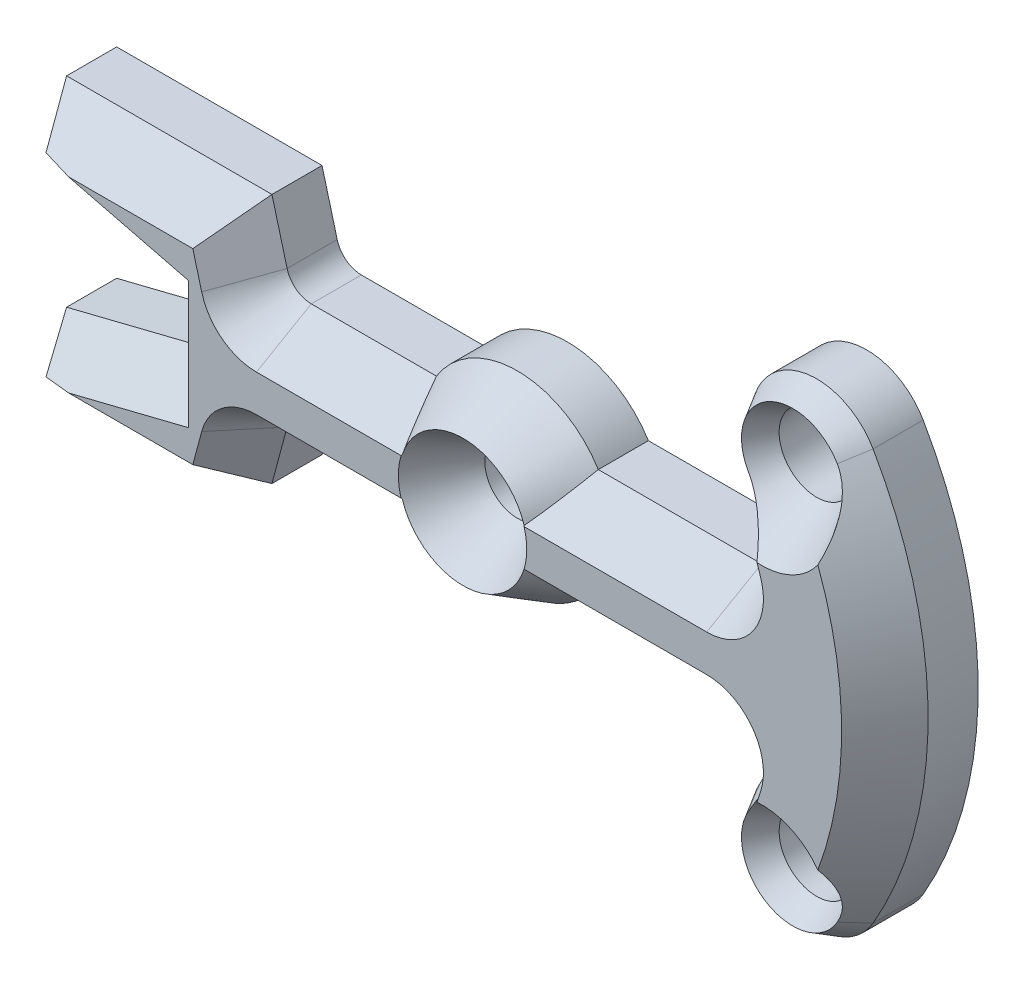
ISO-10303-21;
HEADER;
FILE_DESCRIPTION(('STEP AP214'),'2;1');
FILE_NAME('part.step','',(''),(''),'','','');
FILE_SCHEMA(('AUTOMOTIVE_DESIGN { 1 0 10303 214 1 1 1 1 }'));
ENDSEC;
DATA;
#1=APPLICATION_CONTEXT('core data for automotive mechanical design processes');
#2=APPLICATION_PROTOCOL_DEFINITION('international standard','automotive_design',2000,#1);
#3=PRODUCT_CONTEXT('',#1,'mechanical');
#4=PRODUCT('Part','Part','',(#3));
#5=PRODUCT_RELATED_PRODUCT_CATEGORY('part','',(#4));
#6=PRODUCT_DEFINITION_FORMATION('','',#4);
#7=PRODUCT_DEFINITION_CONTEXT('part definition',#1,'design');
#8=PRODUCT_DEFINITION('design','',#6,#7);
#9=PRODUCT_DEFINITION_SHAPE('','',#8);
#10=(LENGTH_UNIT() NAMED_UNIT(*) SI_UNIT(.MILLI.,.METRE.));
#11=(NAMED_UNIT(*) PLANE_ANGLE_UNIT() SI_UNIT($,.RADIAN.));
#12=(NAMED_UNIT(*) SI_UNIT($,.STERADIAN.) SOLID_ANGLE_UNIT());
#13=UNCERTAINTY_MEASURE_WITH_UNIT(LENGTH_MEASURE(1.E-05),#10,'distance_accuracy_value','');
#14=(GEOMETRIC_REPRESENTATION_CONTEXT(3) GLOBAL_UNCERTAINTY_ASSIGNED_CONTEXT((#13)) GLOBAL_UNIT_ASSIGNED_CONTEXT((#10,
#11,#12)) REPRESENTATION_CONTEXT('',''));
#15=CARTESIAN_POINT('',(0.,0.,0.));
#16=DIRECTION('',(0.,0.,1.));
#17=DIRECTION('',(1.,0.,0.));
#18=AXIS2_PLACEMENT_3D('',#15,#16,#17);
#19=CARTESIAN_POINT('',(-90.,-15.,-10.));
#20=DIRECTION('',(-1.,0.,0.));
#21=DIRECTION('',(0.,0.,1.));
#22=AXIS2_PLACEMENT_3D('',#19,#20,#21);
#23=PLANE('',#22);
#24=DIRECTION('',(0.,-1.,0.));
#25=VECTOR('',#24,1.);
#26=CARTESIAN_POINT('',(-90.,-15.,0.));
#27=LINE('',#26,#25);
#28=CARTESIAN_POINT('',(-90.,-15.,0.));
#29=VERTEX_POINT('',#28);
#30=CARTESIAN_POINT('',(-90.,-25.,0.));
#31=VERTEX_POINT('',#30);
#32=EDGE_CURVE('E223',#29,#31,#27,.T.);
#33=ORIENTED_EDGE('',*,*,#32,.F.);
#34=DIRECTION('',(0.,0.,1.));
#35=VECTOR('',#34,1.);
#36=CARTESIAN_POINT('',(-90.,-15.,-10.));
#37=LINE('',#36,#35);
#38=CARTESIAN_POINT('',(-90.,-15.,-10.));
#39=VERTEX_POINT('',#38);
#40=EDGE_CURVE('E11',#39,#29,#37,.T.);
#41=ORIENTED_EDGE('',*,*,#40,.F.);
#42=DIRECTION('',(0.,-1.,0.));
#43=VECTOR('',#42,1.);
#44=CARTESIAN_POINT('',(-90.,-15.,-10.));
#45=LINE('',#44,#43);
#46=CARTESIAN_POINT('',(-90.,-25.,-10.));
#47=VERTEX_POINT('',#46);
#48=EDGE_CURVE('E292',#39,#47,#45,.T.);
#49=ORIENTED_EDGE('',*,*,#48,.T.);
#50=DIRECTION('',(0.,0.,1.));
#51=VECTOR('',#50,1.);
#52=CARTESIAN_POINT('',(-90.,-25.,-10.));
#53=LINE('',#52,#51);
#54=EDGE_CURVE('E33',#47,#31,#53,.T.);
#55=ORIENTED_EDGE('',*,*,#54,.T.);
#56=EDGE_LOOP('',(#33,#41,#49,#55));
#57=FACE_BOUND('',#56,.T.);
#58=ADVANCED_FACE('F30',(#57),#23,.T.);
#59=CARTESIAN_POINT('',(-61.,-7.76948791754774,-10.));
#60=DIRECTION('',(-0.241921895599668,0.970295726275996,0.));
#61=DIRECTION('',(-0.970295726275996,-0.241921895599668,0.));
#62=AXIS2_PLACEMENT_3D('',#59,#60,#61);
#63=PLANE('',#62);
#64=DIRECTION('',(-0.970295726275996,-0.241921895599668,0.));
#65=VECTOR('',#64,1.);
#66=CARTESIAN_POINT('',(-61.,-7.76948791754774,0.));
#67=LINE('',#66,#65);
#68=CARTESIAN_POINT('',(-61.,-7.76948791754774,0.));
#69=VERTEX_POINT('',#68);
#70=EDGE_CURVE('E290',#69,#29,#67,.T.);
#71=ORIENTED_EDGE('',*,*,#70,.F.);
#72=DIRECTION('',(0.,0.,1.));
#73=VECTOR('',#72,1.);
#74=CARTESIAN_POINT('',(-61.,-7.76948791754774,-10.));
#75=LINE('',#74,#73);
#76=CARTESIAN_POINT('',(-61.,-7.76948791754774,-10.));
#77=VERTEX_POINT('',#76);
#78=EDGE_CURVE('E39',#77,#69,#75,.T.);
#79=ORIENTED_EDGE('',*,*,#78,.F.);
#80=DIRECTION('',(-0.970295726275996,-0.241921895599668,0.));
#81=VECTOR('',#80,1.);
#82=CARTESIAN_POINT('',(-61.,-7.76948791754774,-10.));
#83=LINE('',#82,#81);
#84=EDGE_CURVE('E213',#77,#39,#83,.T.);
#85=ORIENTED_EDGE('',*,*,#84,.T.);
#86=ORIENTED_EDGE('',*,*,#40,.T.);
#87=EDGE_LOOP('',(#71,#79,#85,#86));
#88=FACE_BOUND('',#87,.T.);
#89=ADVANCED_FACE('F366',(#88),#63,.T.);
#90=CARTESIAN_POINT('',(-61.,-7.76948791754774,-10.));
#91=DIRECTION('',(-1.,0.,0.));
#92=DIRECTION('',(0.,0.,1.));
#93=AXIS2_PLACEMENT_3D('',#90,#91,#92);
#94=PLANE('',#93);
#95=DIRECTION('',(0.,-1.,0.));
#96=VECTOR('',#95,1.);
#97=CARTESIAN_POINT('',(-61.,-7.76948791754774,0.));
#98=LINE('',#97,#96);
#99=CARTESIAN_POINT('',(-61.,7.76948791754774,0.));
#100=VERTEX_POINT('',#99);
#101=EDGE_CURVE('E202',#100,#69,#98,.T.);
#102=ORIENTED_EDGE('',*,*,#101,.F.);
#103=DIRECTION('',(0.,0.,1.));
#104=VECTOR('',#103,1.);
#105=CARTESIAN_POINT('',(-61.,7.76948791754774,-10.));
#106=LINE('',#105,#104);
#107=CARTESIAN_POINT('',(-61.,7.76948791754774,-10.));
#108=VERTEX_POINT('',#107);
#109=EDGE_CURVE('E122',#108,#100,#106,.T.);
#110=ORIENTED_EDGE('',*,*,#109,.F.);
#111=DIRECTION('',(0.,-1.,0.));
#112=VECTOR('',#111,1.);
#113=CARTESIAN_POINT('',(-61.,-7.76948791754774,-10.));
#114=LINE('',#113,#112);
#115=EDGE_CURVE('E199',#108,#77,#114,.T.);
#116=ORIENTED_EDGE('',*,*,#115,.T.);
#117=ORIENTED_EDGE('',*,*,#78,.T.);
#118=EDGE_LOOP('',(#102,#110,#116,#117));
#119=FACE_BOUND('',#118,.T.);
#120=ADVANCED_FACE('F198',(#119),#94,.T.);
#121=CARTESIAN_POINT('',(-61.,7.76948791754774,-10.));
#122=DIRECTION('',(-0.241921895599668,-0.970295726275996,0.));
#123=DIRECTION('',(0.970295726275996,-0.241921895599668,0.));
#124=AXIS2_PLACEMENT_3D('',#121,#122,#123);
#125=PLANE('',#124);
#126=DIRECTION('',(0.970295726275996,-0.241921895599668,0.));
#127=VECTOR('',#126,1.);
#128=CARTESIAN_POINT('',(-61.,7.76948791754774,0.));
#129=LINE('',#128,#127);
#130=CARTESIAN_POINT('',(-90.,15.,0.));
#131=VERTEX_POINT('',#130);
#132=EDGE_CURVE('E287',#131,#100,#129,.T.);
#133=ORIENTED_EDGE('',*,*,#132,.F.);
#134=DIRECTION('',(0.,0.,1.));
#135=VECTOR('',#134,1.);
#136=CARTESIAN_POINT('',(-90.,15.,-10.));
#137=LINE('',#136,#135);
#138=CARTESIAN_POINT('',(-90.,15.,-10.));
#139=VERTEX_POINT('',#138);
#140=EDGE_CURVE('E204',#139,#131,#137,.T.);
#141=ORIENTED_EDGE('',*,*,#140,.F.);
#142=DIRECTION('',(0.970295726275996,-0.241921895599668,0.));
#143=VECTOR('',#142,1.);
#144=CARTESIAN_POINT('',(-61.,7.76948791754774,-10.));
#145=LINE('',#144,#143);
#146=EDGE_CURVE('E210',#139,#108,#145,.T.);
#147=ORIENTED_EDGE('',*,*,#146,.T.);
#148=ORIENTED_EDGE('',*,*,#109,.T.);
#149=EDGE_LOOP('',(#133,#141,#147,#148));
#150=FACE_BOUND('',#149,.T.);
#151=ADVANCED_FACE('F215',(#150),#125,.T.);
#152=CARTESIAN_POINT('',(-90.,15.,-10.));
#153=DIRECTION('',(-1.,0.,0.));
#154=DIRECTION('',(0.,0.,1.));
#155=AXIS2_PLACEMENT_3D('',#152,#153,#154);
#156=PLANE('',#155);
#157=DIRECTION('',(0.,-1.,0.));
#158=VECTOR('',#157,1.);
#159=CARTESIAN_POINT('',(-90.,15.,0.));
#160=LINE('',#159,#158);
#161=CARTESIAN_POINT('',(-90.,25.,0.));
#162=VERTEX_POINT('',#161);
#163=EDGE_CURVE('E284',#162,#131,#160,.T.);
#164=ORIENTED_EDGE('',*,*,#163,.F.);
#165=DIRECTION('',(0.,0.,1.));
#166=VECTOR('',#165,1.);
#167=CARTESIAN_POINT('',(-90.,25.,-10.));
#168=LINE('',#167,#166);
#169=CARTESIAN_POINT('',(-90.,25.,-10.));
#170=VERTEX_POINT('',#169);
#171=EDGE_CURVE('E296',#170,#162,#168,.T.);
#172=ORIENTED_EDGE('',*,*,#171,.F.);
#173=DIRECTION('',(0.,-1.,0.));
#174=VECTOR('',#173,1.);
#175=CARTESIAN_POINT('',(-90.,15.,-10.));
#176=LINE('',#175,#174);
#177=EDGE_CURVE('E216',#170,#139,#176,.T.);
#178=ORIENTED_EDGE('',*,*,#177,.T.);
#179=ORIENTED_EDGE('',*,*,#140,.T.);
#180=EDGE_LOOP('',(#164,#172,#178,#179));
#181=FACE_BOUND('',#180,.T.);
#182=ADVANCED_FACE('F629',(#181),#156,.T.);
#183=CARTESIAN_POINT('',(-90.,25.,-10.));
#184=DIRECTION('',(0.,1.,0.));
#185=DIRECTION('',(0.,0.,1.));
#186=AXIS2_PLACEMENT_3D('',#183,#184,#185);
#187=PLANE('',#186);
#188=DIRECTION('',(-1.,0.,0.));
#189=VECTOR('',#188,1.);
#190=CARTESIAN_POINT('',(-90.,25.,0.));
#191=LINE('',#190,#189);
#192=CARTESIAN_POINT('',(-49.,25.,0.));
#193=VERTEX_POINT('',#192);
#194=EDGE_CURVE('E281',#193,#162,#191,.T.);
#195=ORIENTED_EDGE('',*,*,#194,.F.);
#196=DIRECTION('',(0.,0.,1.));
#197=VECTOR('',#196,1.);
#198=CARTESIAN_POINT('',(-49.,25.,-10.));
#199=LINE('',#198,#197);
#200=CARTESIAN_POINT('',(-49.,25.,-10.));
#201=VERTEX_POINT('',#200);
#202=EDGE_CURVE('E298',#201,#193,#199,.T.);
#203=ORIENTED_EDGE('',*,*,#202,.F.);
#204=DIRECTION('',(-1.,0.,0.));
#205=VECTOR('',#204,1.);
#206=CARTESIAN_POINT('',(-90.,25.,-10.));
#207=LINE('',#206,#205);
#208=EDGE_CURVE('E218',#201,#170,#207,.T.);
#209=ORIENTED_EDGE('',*,*,#208,.T.);
#210=ORIENTED_EDGE('',*,*,#171,.T.);
#211=EDGE_LOOP('',(#195,#203,#209,#210));
#212=FACE_BOUND('',#211,.T.);
#213=ADVANCED_FACE('F632',(#212),#187,.T.);
#214=CARTESIAN_POINT('',(-49.,25.,-10.));
#215=DIRECTION('',(0.965925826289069,0.258819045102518,0.));
#216=DIRECTION('',(-0.258819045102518,0.965925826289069,0.));
#217=AXIS2_PLACEMENT_3D('',#214,#215,#216);
#218=PLANE('',#217);
#219=DIRECTION('',(-0.258819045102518,0.965925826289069,0.));
#220=VECTOR('',#219,1.);
#221=CARTESIAN_POINT('',(-49.,25.,0.));
#222=LINE('',#221,#220);
#223=CARTESIAN_POINT('',(-45.9737563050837,13.7059047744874,0.));
#224=VERTEX_POINT('',#223);
#225=EDGE_CURVE('E278',#224,#193,#222,.T.);
#226=ORIENTED_EDGE('',*,*,#225,.F.);
#227=DIRECTION('',(0.,0.,1.));
#228=VECTOR('',#227,1.);
#229=CARTESIAN_POINT('',(-45.9737563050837,13.7059047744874,-10.));
#230=LINE('',#229,#228);
#231=CARTESIAN_POINT('',(-45.9737563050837,13.7059047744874,-10.));
#232=VERTEX_POINT('',#231);
#233=EDGE_CURVE('E300',#232,#224,#230,.T.);
#234=ORIENTED_EDGE('',*,*,#233,.F.);
#235=DIRECTION('',(-0.258819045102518,0.965925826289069,0.));
#236=VECTOR('',#235,1.);
#237=CARTESIAN_POINT('',(-49.,25.,-10.));
#238=LINE('',#237,#236);
#239=EDGE_CURVE('E780',#232,#201,#238,.T.);
#240=ORIENTED_EDGE('',*,*,#239,.T.);
#241=ORIENTED_EDGE('',*,*,#202,.T.);
#242=EDGE_LOOP('',(#226,#234,#240,#241));
#243=FACE_BOUND('',#242,.T.);
#244=ADVANCED_FACE('F636',(#243),#218,.T.);
#245=CARTESIAN_POINT('',(-41.1441271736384,15.,-10.));
#246=DIRECTION('',(0.,0.,1.));
#247=DIRECTION('',(1.,0.,0.));
#248=AXIS2_PLACEMENT_3D('',#245,#246,#247);
#249=CYLINDRICAL_SURFACE('',#248,5.);
#250=CARTESIAN_POINT('',(-41.1441271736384,15.,0.));
#251=DIRECTION('',(0.,0.,-1.));
#252=DIRECTION('',(1.,0.,0.));
#253=AXIS2_PLACEMENT_3D('',#250,#251,#252);
#254=CIRCLE('',#253,5.);
#255=CARTESIAN_POINT('',(-41.1441271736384,10.,0.));
#256=VERTEX_POINT('',#255);
#257=EDGE_CURVE('E275',#256,#224,#254,.T.);
#258=ORIENTED_EDGE('',*,*,#257,.F.);
#259=DIRECTION('',(0.,0.,1.));
#260=VECTOR('',#259,1.);
#261=CARTESIAN_POINT('',(-41.1441271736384,10.,-10.));
#262=LINE('',#261,#260);
#263=CARTESIAN_POINT('',(-41.1441271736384,10.,-10.));
#264=VERTEX_POINT('',#263);
#265=EDGE_CURVE('E302',#264,#256,#262,.T.);
#266=ORIENTED_EDGE('',*,*,#265,.F.);
#267=CARTESIAN_POINT('',(-41.1441271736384,15.,-10.));
#268=DIRECTION('',(0.,0.,-1.));
#269=DIRECTION('',(1.,0.,0.));
#270=AXIS2_PLACEMENT_3D('',#267,#268,#269);
#271=CIRCLE('',#270,5.);
#272=EDGE_CURVE('E777',#264,#232,#271,.T.);
#273=ORIENTED_EDGE('',*,*,#272,.T.);
#274=ORIENTED_EDGE('',*,*,#233,.T.);
#275=EDGE_LOOP('',(#258,#266,#273,#274));
#276=FACE_BOUND('',#275,.T.);
#277=ADVANCED_FACE('F640',(#276),#249,.F.);
#278=CARTESIAN_POINT('',(-41.1441271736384,10.,-10.));
#279=DIRECTION('',(0.,1.,0.));
#280=DIRECTION('',(0.,0.,1.));
#281=AXIS2_PLACEMENT_3D('',#278,#279,#280);
#282=PLANE('',#281);
#283=DIRECTION('',(-1.,0.,0.));
#284=VECTOR('',#283,1.);
#285=CARTESIAN_POINT('',(-41.1441271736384,10.,0.));
#286=LINE('',#285,#284);
#287=CARTESIAN_POINT('',(-16.1554944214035,10.,0.));
#288=VERTEX_POINT('',#287);
#289=EDGE_CURVE('E272',#288,#256,#286,.T.);
#290=ORIENTED_EDGE('',*,*,#289,.F.);
#291=DIRECTION('',(0.,0.,1.));
#292=VECTOR('',#291,1.);
#293=CARTESIAN_POINT('',(-16.1554944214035,10.,-10.));
#294=LINE('',#293,#292);
#295=CARTESIAN_POINT('',(-16.1554944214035,10.,-10.));
#296=VERTEX_POINT('',#295);
#297=EDGE_CURVE('E304',#296,#288,#294,.T.);
#298=ORIENTED_EDGE('',*,*,#297,.F.);
#299=DIRECTION('',(-1.,0.,0.));
#300=VECTOR('',#299,1.);
#301=CARTESIAN_POINT('',(-41.1441271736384,10.,-10.));
#302=LINE('',#301,#300);
#303=EDGE_CURVE('E774',#296,#264,#302,.T.);
#304=ORIENTED_EDGE('',*,*,#303,.T.);
#305=ORIENTED_EDGE('',*,*,#265,.T.);
#306=EDGE_LOOP('',(#290,#298,#304,#305));
#307=FACE_BOUND('',#306,.T.);
#308=ADVANCED_FACE('F644',(#307),#282,.T.);
#309=CARTESIAN_POINT('',(0.,0.,-10.));
#310=DIRECTION('',(0.,0.,1.));
#311=DIRECTION('',(1.,0.,0.));
#312=AXIS2_PLACEMENT_3D('',#309,#310,#311);
#313=CYLINDRICAL_SURFACE('',#312,19.);
#314=CARTESIAN_POINT('',(0.,0.,0.));
#315=DIRECTION('',(0.,0.,1.));
#316=DIRECTION('',(1.,0.,0.));
#317=AXIS2_PLACEMENT_3D('',#314,#315,#316);
#318=CIRCLE('',#317,19.);
#319=CARTESIAN_POINT('',(16.1554944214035,10.,0.));
#320=VERTEX_POINT('',#319);
#321=EDGE_CURVE('E269',#320,#288,#318,.T.);
#322=ORIENTED_EDGE('',*,*,#321,.F.);
#323=DIRECTION('',(0.,0.,1.));
#324=VECTOR('',#323,1.);
#325=CARTESIAN_POINT('',(16.1554944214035,10.,-10.));
#326=LINE('',#325,#324);
#327=CARTESIAN_POINT('',(16.1554944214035,10.,-10.));
#328=VERTEX_POINT('',#327);
#329=EDGE_CURVE('E306',#328,#320,#326,.T.);
#330=ORIENTED_EDGE('',*,*,#329,.F.);
#331=CARTESIAN_POINT('',(0.,0.,-10.));
#332=DIRECTION('',(0.,0.,1.));
#333=DIRECTION('',(1.,0.,0.));
#334=AXIS2_PLACEMENT_3D('',#331,#332,#333);
#335=CIRCLE('',#334,19.);
#336=EDGE_CURVE('E771',#328,#296,#335,.T.);
#337=ORIENTED_EDGE('',*,*,#336,.T.);
#338=ORIENTED_EDGE('',*,*,#297,.T.);
#339=EDGE_LOOP('',(#322,#330,#337,#338));
#340=FACE_BOUND('',#339,.T.);
#341=ADVANCED_FACE('F648',(#340),#313,.T.);
#342=CARTESIAN_POINT('',(16.1554944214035,10.,-10.));
#343=DIRECTION('',(0.,1.,0.));
#344=DIRECTION('',(0.,0.,1.));
#345=AXIS2_PLACEMENT_3D('',#342,#343,#344);
#346=PLANE('',#345);
#347=DIRECTION('',(-1.,0.,0.));
#348=VECTOR('',#347,1.);
#349=CARTESIAN_POINT('',(16.1554944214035,10.,0.));
#350=LINE('',#349,#348);
#351=CARTESIAN_POINT('',(48.7442304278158,10.,0.));
#352=VERTEX_POINT('',#351);
#353=EDGE_CURVE('E266',#352,#320,#350,.T.);
#354=ORIENTED_EDGE('',*,*,#353,.F.);
#355=DIRECTION('',(0.,0.,1.));
#356=VECTOR('',#355,1.);
#357=CARTESIAN_POINT('',(48.7442304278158,10.,-10.));
#358=LINE('',#357,#356);
#359=CARTESIAN_POINT('',(48.7442304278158,10.,-10.));
#360=VERTEX_POINT('',#359);
#361=EDGE_CURVE('E308',#360,#352,#358,.T.);
#362=ORIENTED_EDGE('',*,*,#361,.F.);
#363=DIRECTION('',(-1.,0.,0.));
#364=VECTOR('',#363,1.);
#365=CARTESIAN_POINT('',(16.1554944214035,10.,-10.));
#366=LINE('',#365,#364);
#367=EDGE_CURVE('E768',#360,#328,#366,.T.);
#368=ORIENTED_EDGE('',*,*,#367,.T.);
#369=ORIENTED_EDGE('',*,*,#329,.T.);
#370=EDGE_LOOP('',(#354,#362,#368,#369));
#371=FACE_BOUND('',#370,.T.);
#372=ADVANCED_FACE('F652',(#371),#346,.T.);
#373=CARTESIAN_POINT('',(48.7442304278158,15.,-10.));
#374=DIRECTION('',(0.,0.,1.));
#375=DIRECTION('',(1.,0.,0.));
#376=AXIS2_PLACEMENT_3D('',#373,#374,#375);
#377=CYLINDRICAL_SURFACE('',#376,5.);
#378=CARTESIAN_POINT('',(48.7442304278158,15.,0.));
#379=DIRECTION('',(0.,0.,-1.));
#380=DIRECTION('',(1.,0.,0.));
#381=AXIS2_PLACEMENT_3D('',#378,#379,#380);
#382=CIRCLE('',#381,5.);
#383=CARTESIAN_POINT('',(53.5230765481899,16.4705882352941,0.));
#384=VERTEX_POINT('',#383);
#385=EDGE_CURVE('E263',#384,#352,#382,.T.);
#386=ORIENTED_EDGE('',*,*,#385,.F.);
#387=DIRECTION('',(0.,0.,1.));
#388=VECTOR('',#387,1.);
#389=CARTESIAN_POINT('',(53.5230765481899,16.4705882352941,-10.));
#390=LINE('',#389,#388);
#391=CARTESIAN_POINT('',(53.5230765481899,16.4705882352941,-10.));
#392=VERTEX_POINT('',#391);
#393=EDGE_CURVE('E310',#392,#384,#390,.T.);
#394=ORIENTED_EDGE('',*,*,#393,.F.);
#395=CARTESIAN_POINT('',(48.7442304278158,15.,-10.));
#396=DIRECTION('',(0.,0.,-1.));
#397=DIRECTION('',(1.,0.,0.));
#398=AXIS2_PLACEMENT_3D('',#395,#396,#397);
#399=CIRCLE('',#398,5.);
#400=EDGE_CURVE('E765',#392,#360,#399,.T.);
#401=ORIENTED_EDGE('',*,*,#400,.T.);
#402=ORIENTED_EDGE('',*,*,#361,.T.);
#403=EDGE_LOOP('',(#386,#394,#401,#402));
#404=FACE_BOUND('',#403,.T.);
#405=ADVANCED_FACE('F656',(#404),#377,.F.);
#406=CARTESIAN_POINT('',(0.,0.,-10.));
#407=DIRECTION('',(0.,0.,1.));
#408=DIRECTION('',(1.,0.,0.));
#409=AXIS2_PLACEMENT_3D('',#406,#407,#408);
#410=CYLINDRICAL_SURFACE('',#409,56.);
#411=CARTESIAN_POINT('',(0.,0.,0.));
#412=DIRECTION('',(0.,0.,-1.));
#413=DIRECTION('',(1.,0.,0.));
#414=AXIS2_PLACEMENT_3D('',#411,#412,#413);
#415=CIRCLE('',#414,56.);
#416=CARTESIAN_POINT('',(48.4974226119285,28.0000000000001,0.));
#417=VERTEX_POINT('',#416);
#418=EDGE_CURVE('E260',#417,#384,#415,.T.);
#419=ORIENTED_EDGE('',*,*,#418,.F.);
#420=DIRECTION('',(0.,0.,1.));
#421=VECTOR('',#420,1.);
#422=CARTESIAN_POINT('',(48.4974226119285,28.0000000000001,-10.));
#423=LINE('',#422,#421);
#424=CARTESIAN_POINT('',(48.4974226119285,28.0000000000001,-10.));
#425=VERTEX_POINT('',#424);
#426=EDGE_CURVE('E312',#425,#417,#423,.T.);
#427=ORIENTED_EDGE('',*,*,#426,.F.);
#428=CARTESIAN_POINT('',(0.,0.,-10.));
#429=DIRECTION('',(0.,0.,-1.));
#430=DIRECTION('',(1.,0.,0.));
#431=AXIS2_PLACEMENT_3D('',#428,#429,#430);
#432=CIRCLE('',#431,56.);
#433=EDGE_CURVE('E762',#425,#392,#432,.T.);
#434=ORIENTED_EDGE('',*,*,#433,.T.);
#435=ORIENTED_EDGE('',*,*,#393,.T.);
#436=EDGE_LOOP('',(#419,#427,#434,#435));
#437=FACE_BOUND('',#436,.T.);
#438=ADVANCED_FACE('F660',(#437),#410,.F.);
#439=CARTESIAN_POINT('',(59.7557528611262,34.5000000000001,-10.));
#440=DIRECTION('',(0.,0.,1.));
#441=DIRECTION('',(1.,0.,0.));
#442=AXIS2_PLACEMENT_3D('',#439,#440,#441);
#443=CYLINDRICAL_SURFACE('',#442,13.);
#444=CARTESIAN_POINT('',(59.7557528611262,34.5000000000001,0.));
#445=DIRECTION('',(0.,0.,1.));
#446=DIRECTION('',(1.,0.,0.));
#447=AXIS2_PLACEMENT_3D('',#444,#445,#446);
#448=CIRCLE('',#447,13.);
#449=CARTESIAN_POINT('',(71.0140831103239,41.0000000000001,0.));
#450=VERTEX_POINT('',#449);
#451=EDGE_CURVE('E257',#450,#417,#448,.T.);
#452=ORIENTED_EDGE('',*,*,#451,.F.);
#453=DIRECTION('',(0.,0.,1.));
#454=VECTOR('',#453,1.);
#455=CARTESIAN_POINT('',(71.0140831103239,41.0000000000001,-10.));
#456=LINE('',#455,#454);
#457=CARTESIAN_POINT('',(71.0140831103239,41.0000000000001,-10.));
#458=VERTEX_POINT('',#457);
#459=EDGE_CURVE('E314',#458,#450,#456,.T.);
#460=ORIENTED_EDGE('',*,*,#459,.F.);
#461=CARTESIAN_POINT('',(59.7557528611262,34.5000000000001,-10.));
#462=DIRECTION('',(0.,0.,1.));
#463=DIRECTION('',(1.,0.,0.));
#464=AXIS2_PLACEMENT_3D('',#461,#462,#463);
#465=CIRCLE('',#464,13.);
#466=EDGE_CURVE('E759',#458,#425,#465,.T.);
#467=ORIENTED_EDGE('',*,*,#466,.T.);
#468=ORIENTED_EDGE('',*,*,#426,.T.);
#469=EDGE_LOOP('',(#452,#460,#467,#468));
#470=FACE_BOUND('',#469,.T.);
#471=ADVANCED_FACE('F664',(#470),#443,.T.);
#472=CARTESIAN_POINT('',(0.,0.,-10.));
#473=DIRECTION('',(0.,0.,1.));
#474=DIRECTION('',(1.,0.,0.));
#475=AXIS2_PLACEMENT_3D('',#472,#473,#474);
#476=CYLINDRICAL_SURFACE('',#475,82.);
#477=CARTESIAN_POINT('',(0.,0.,0.));
#478=DIRECTION('',(0.,0.,1.));
#479=DIRECTION('',(1.,0.,0.));
#480=AXIS2_PLACEMENT_3D('',#477,#478,#479);
#481=CIRCLE('',#480,82.);
#482=CARTESIAN_POINT('',(71.0140831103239,-41.0000000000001,0.));
#483=VERTEX_POINT('',#482);
#484=EDGE_CURVE('E254',#483,#450,#481,.T.);
#485=ORIENTED_EDGE('',*,*,#484,.F.);
#486=DIRECTION('',(0.,0.,1.));
#487=VECTOR('',#486,1.);
#488=CARTESIAN_POINT('',(71.0140831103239,-41.0000000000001,-10.));
#489=LINE('',#488,#487);
#490=CARTESIAN_POINT('',(71.0140831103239,-41.0000000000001,-10.));
#491=VERTEX_POINT('',#490);
#492=EDGE_CURVE('E316',#491,#483,#489,.T.);
#493=ORIENTED_EDGE('',*,*,#492,.F.);
#494=CARTESIAN_POINT('',(0.,0.,-10.));
#495=DIRECTION('',(0.,0.,1.));
#496=DIRECTION('',(1.,0.,0.));
#497=AXIS2_PLACEMENT_3D('',#494,#495,#496);
#498=CIRCLE('',#497,82.);
#499=EDGE_CURVE('E756',#491,#458,#498,.T.);
#500=ORIENTED_EDGE('',*,*,#499,.T.);
#501=ORIENTED_EDGE('',*,*,#459,.T.);
#502=EDGE_LOOP('',(#485,#493,#500,#501));
#503=FACE_BOUND('',#502,.T.);
#504=ADVANCED_FACE('F668',(#503),#476,.T.);
#505=CARTESIAN_POINT('',(59.7557528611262,-34.5000000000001,-10.));
#506=DIRECTION('',(0.,0.,1.));
#507=DIRECTION('',(1.,0.,0.));
#508=AXIS2_PLACEMENT_3D('',#505,#506,#507);
#509=CYLINDRICAL_SURFACE('',#508,13.);
#510=CARTESIAN_POINT('',(59.7557528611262,-34.5000000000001,0.));
#511=DIRECTION('',(0.,0.,1.));
#512=DIRECTION('',(-1.,0.,0.));
#513=AXIS2_PLACEMENT_3D('',#510,#511,#512);
#514=CIRCLE('',#513,13.);
#515=CARTESIAN_POINT('',(48.4974226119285,-28.0000000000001,0.));
#516=VERTEX_POINT('',#515);
#517=EDGE_CURVE('E251',#516,#483,#514,.T.);
#518=ORIENTED_EDGE('',*,*,#517,.F.);
#519=DIRECTION('',(0.,0.,1.));
#520=VECTOR('',#519,1.);
#521=CARTESIAN_POINT('',(48.4974226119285,-28.0000000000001,-10.));
#522=LINE('',#521,#520);
#523=CARTESIAN_POINT('',(48.4974226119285,-28.0000000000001,-10.));
#524=VERTEX_POINT('',#523);
#525=EDGE_CURVE('E318',#524,#516,#522,.T.);
#526=ORIENTED_EDGE('',*,*,#525,.F.);
#527=CARTESIAN_POINT('',(59.7557528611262,-34.5000000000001,-10.));
#528=DIRECTION('',(0.,0.,1.));
#529=DIRECTION('',(-1.,0.,0.));
#530=AXIS2_PLACEMENT_3D('',#527,#528,#529);
#531=CIRCLE('',#530,13.);
#532=EDGE_CURVE('E753',#524,#491,#531,.T.);
#533=ORIENTED_EDGE('',*,*,#532,.T.);
#534=ORIENTED_EDGE('',*,*,#492,.T.);
#535=EDGE_LOOP('',(#518,#526,#533,#534));
#536=FACE_BOUND('',#535,.T.);
#537=ADVANCED_FACE('F672',(#536),#509,.T.);
#538=CARTESIAN_POINT('',(0.,0.,-10.));
#539=DIRECTION('',(0.,0.,1.));
#540=DIRECTION('',(1.,0.,0.));
#541=AXIS2_PLACEMENT_3D('',#538,#539,#540);
#542=CYLINDRICAL_SURFACE('',#541,56.);
#543=CARTESIAN_POINT('',(0.,0.,0.));
#544=DIRECTION('',(0.,0.,-1.));
#545=DIRECTION('',(1.,0.,0.));
#546=AXIS2_PLACEMENT_3D('',#543,#544,#545);
#547=CIRCLE('',#546,56.);
#548=CARTESIAN_POINT('',(53.5230765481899,-16.4705882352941,0.));
#549=VERTEX_POINT('',#548);
#550=EDGE_CURVE('E248',#549,#516,#547,.T.);
#551=ORIENTED_EDGE('',*,*,#550,.F.);
#552=DIRECTION('',(0.,0.,1.));
#553=VECTOR('',#552,1.);
#554=CARTESIAN_POINT('',(53.5230765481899,-16.4705882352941,-10.));
#555=LINE('',#554,#553);
#556=CARTESIAN_POINT('',(53.5230765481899,-16.4705882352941,-10.));
#557=VERTEX_POINT('',#556);
#558=EDGE_CURVE('E320',#557,#549,#555,.T.);
#559=ORIENTED_EDGE('',*,*,#558,.F.);
#560=CARTESIAN_POINT('',(0.,0.,-10.));
#561=DIRECTION('',(0.,0.,-1.));
#562=DIRECTION('',(1.,0.,0.));
#563=AXIS2_PLACEMENT_3D('',#560,#561,#562);
#564=CIRCLE('',#563,56.);
#565=EDGE_CURVE('E750',#557,#524,#564,.T.);
#566=ORIENTED_EDGE('',*,*,#565,.T.);
#567=ORIENTED_EDGE('',*,*,#525,.T.);
#568=EDGE_LOOP('',(#551,#559,#566,#567));
#569=FACE_BOUND('',#568,.T.);
#570=ADVANCED_FACE('F676',(#569),#542,.F.);
#571=CARTESIAN_POINT('',(48.7442304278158,-15.,-10.));
#572=DIRECTION('',(0.,0.,1.));
#573=DIRECTION('',(1.,0.,0.));
#574=AXIS2_PLACEMENT_3D('',#571,#572,#573);
#575=CYLINDRICAL_SURFACE('',#574,5.);
#576=CARTESIAN_POINT('',(48.7442304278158,-15.,0.));
#577=DIRECTION('',(0.,0.,-1.));
#578=DIRECTION('',(-1.,0.,0.));
#579=AXIS2_PLACEMENT_3D('',#576,#577,#578);
#580=CIRCLE('',#579,5.);
#581=CARTESIAN_POINT('',(48.7442304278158,-10.,0.));
#582=VERTEX_POINT('',#581);
#583=EDGE_CURVE('E245',#582,#549,#580,.T.);
#584=ORIENTED_EDGE('',*,*,#583,.F.);
#585=DIRECTION('',(0.,0.,1.));
#586=VECTOR('',#585,1.);
#587=CARTESIAN_POINT('',(48.7442304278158,-10.,-10.));
#588=LINE('',#587,#586);
#589=CARTESIAN_POINT('',(48.7442304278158,-10.,-10.));
#590=VERTEX_POINT('',#589);
#591=EDGE_CURVE('E322',#590,#582,#588,.T.);
#592=ORIENTED_EDGE('',*,*,#591,.F.);
#593=CARTESIAN_POINT('',(48.7442304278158,-15.,-10.));
#594=DIRECTION('',(0.,0.,-1.));
#595=DIRECTION('',(-1.,0.,0.));
#596=AXIS2_PLACEMENT_3D('',#593,#594,#595);
#597=CIRCLE('',#596,5.);
#598=EDGE_CURVE('E747',#590,#557,#597,.T.);
#599=ORIENTED_EDGE('',*,*,#598,.T.);
#600=ORIENTED_EDGE('',*,*,#558,.T.);
#601=EDGE_LOOP('',(#584,#592,#599,#600));
#602=FACE_BOUND('',#601,.T.);
#603=ADVANCED_FACE('F680',(#602),#575,.F.);
#604=CARTESIAN_POINT('',(16.1554944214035,-10.,-10.));
#605=DIRECTION('',(0.,-1.,0.));
#606=DIRECTION('',(0.,0.,-1.));
#607=AXIS2_PLACEMENT_3D('',#604,#605,#606);
#608=PLANE('',#607);
#609=DIRECTION('',(1.,0.,0.));
#610=VECTOR('',#609,1.);
#611=CARTESIAN_POINT('',(16.1554944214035,-10.,0.));
#612=LINE('',#611,#610);
#613=CARTESIAN_POINT('',(16.1554944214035,-10.,0.));
#614=VERTEX_POINT('',#613);
#615=EDGE_CURVE('E242',#614,#582,#612,.T.);
#616=ORIENTED_EDGE('',*,*,#615,.F.);
#617=DIRECTION('',(0.,0.,1.));
#618=VECTOR('',#617,1.);
#619=CARTESIAN_POINT('',(16.1554944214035,-10.,-10.));
#620=LINE('',#619,#618);
#621=CARTESIAN_POINT('',(16.1554944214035,-10.,-10.));
#622=VERTEX_POINT('',#621);
#623=EDGE_CURVE('E324',#622,#614,#620,.T.);
#624=ORIENTED_EDGE('',*,*,#623,.F.);
#625=DIRECTION('',(1.,0.,0.));
#626=VECTOR('',#625,1.);
#627=CARTESIAN_POINT('',(16.1554944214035,-10.,-10.));
#628=LINE('',#627,#626);
#629=EDGE_CURVE('E744',#622,#590,#628,.T.);
#630=ORIENTED_EDGE('',*,*,#629,.T.);
#631=ORIENTED_EDGE('',*,*,#591,.T.);
#632=EDGE_LOOP('',(#616,#624,#630,#631));
#633=FACE_BOUND('',#632,.T.);
#634=ADVANCED_FACE('F684',(#633),#608,.T.);
#635=CARTESIAN_POINT('',(0.,0.,-10.));
#636=DIRECTION('',(0.,0.,1.));
#637=DIRECTION('',(1.,0.,0.));
#638=AXIS2_PLACEMENT_3D('',#635,#636,#637);
#639=CYLINDRICAL_SURFACE('',#638,19.);
#640=CARTESIAN_POINT('',(0.,0.,0.));
#641=DIRECTION('',(0.,0.,1.));
#642=DIRECTION('',(1.,0.,0.));
#643=AXIS2_PLACEMENT_3D('',#640,#641,#642);
#644=CIRCLE('',#643,19.);
#645=CARTESIAN_POINT('',(-16.1554944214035,-10.,0.));
#646=VERTEX_POINT('',#645);
#647=EDGE_CURVE('E239',#646,#614,#644,.T.);
#648=ORIENTED_EDGE('',*,*,#647,.F.);
#649=DIRECTION('',(0.,0.,1.));
#650=VECTOR('',#649,1.);
#651=CARTESIAN_POINT('',(-16.1554944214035,-10.,-10.));
#652=LINE('',#651,#650);
#653=CARTESIAN_POINT('',(-16.1554944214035,-10.,-10.));
#654=VERTEX_POINT('',#653);
#655=EDGE_CURVE('E326',#654,#646,#652,.T.);
#656=ORIENTED_EDGE('',*,*,#655,.F.);
#657=CARTESIAN_POINT('',(0.,0.,-10.));
#658=DIRECTION('',(0.,0.,1.));
#659=DIRECTION('',(1.,0.,0.));
#660=AXIS2_PLACEMENT_3D('',#657,#658,#659);
#661=CIRCLE('',#660,19.);
#662=EDGE_CURVE('E741',#654,#622,#661,.T.);
#663=ORIENTED_EDGE('',*,*,#662,.T.);
#664=ORIENTED_EDGE('',*,*,#623,.T.);
#665=EDGE_LOOP('',(#648,#656,#663,#664));
#666=FACE_BOUND('',#665,.T.);
#667=ADVANCED_FACE('F688',(#666),#639,.T.);
#668=CARTESIAN_POINT('',(-41.1441271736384,-10.,-10.));
#669=DIRECTION('',(0.,-1.,0.));
#670=DIRECTION('',(0.,0.,-1.));
#671=AXIS2_PLACEMENT_3D('',#668,#669,#670);
#672=PLANE('',#671);
#673=DIRECTION('',(1.,0.,0.));
#674=VECTOR('',#673,1.);
#675=CARTESIAN_POINT('',(-41.1441271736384,-10.,0.));
#676=LINE('',#675,#674);
#677=CARTESIAN_POINT('',(-41.1441271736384,-10.,0.));
#678=VERTEX_POINT('',#677);
#679=EDGE_CURVE('E236',#678,#646,#676,.T.);
#680=ORIENTED_EDGE('',*,*,#679,.F.);
#681=DIRECTION('',(0.,0.,1.));
#682=VECTOR('',#681,1.);
#683=CARTESIAN_POINT('',(-41.1441271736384,-10.,-10.));
#684=LINE('',#683,#682);
#685=CARTESIAN_POINT('',(-41.1441271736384,-10.,-10.));
#686=VERTEX_POINT('',#685);
#687=EDGE_CURVE('E328',#686,#678,#684,.T.);
#688=ORIENTED_EDGE('',*,*,#687,.F.);
#689=DIRECTION('',(1.,0.,0.));
#690=VECTOR('',#689,1.);
#691=CARTESIAN_POINT('',(-41.1441271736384,-10.,-10.));
#692=LINE('',#691,#690);
#693=EDGE_CURVE('E738',#686,#654,#692,.T.);
#694=ORIENTED_EDGE('',*,*,#693,.T.);
#695=ORIENTED_EDGE('',*,*,#655,.T.);
#696=EDGE_LOOP('',(#680,#688,#694,#695));
#697=FACE_BOUND('',#696,.T.);
#698=ADVANCED_FACE('F692',(#697),#672,.T.);
#699=CARTESIAN_POINT('',(-41.1441271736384,-15.,-10.));
#700=DIRECTION('',(0.,0.,1.));
#701=DIRECTION('',(1.,0.,0.));
#702=AXIS2_PLACEMENT_3D('',#699,#700,#701);
#703=CYLINDRICAL_SURFACE('',#702,5.);
#704=CARTESIAN_POINT('',(-41.1441271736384,-15.,0.));
#705=DIRECTION('',(0.,0.,-1.));
#706=DIRECTION('',(-1.,0.,0.));
#707=AXIS2_PLACEMENT_3D('',#704,#705,#706);
#708=CIRCLE('',#707,5.);
#709=CARTESIAN_POINT('',(-45.9737563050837,-13.7059047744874,0.));
#710=VERTEX_POINT('',#709);
#711=EDGE_CURVE('E233',#710,#678,#708,.T.);
#712=ORIENTED_EDGE('',*,*,#711,.F.);
#713=DIRECTION('',(0.,0.,1.));
#714=VECTOR('',#713,1.);
#715=CARTESIAN_POINT('',(-45.9737563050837,-13.7059047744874,-10.));
#716=LINE('',#715,#714);
#717=CARTESIAN_POINT('',(-45.9737563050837,-13.7059047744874,-10.));
#718=VERTEX_POINT('',#717);
#719=EDGE_CURVE('E330',#718,#710,#716,.T.);
#720=ORIENTED_EDGE('',*,*,#719,.F.);
#721=CARTESIAN_POINT('',(-41.1441271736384,-15.,-10.));
#722=DIRECTION('',(0.,0.,-1.));
#723=DIRECTION('',(-1.,0.,0.));
#724=AXIS2_PLACEMENT_3D('',#721,#722,#723);
#725=CIRCLE('',#724,5.);
#726=EDGE_CURVE('E735',#718,#686,#725,.T.);
#727=ORIENTED_EDGE('',*,*,#726,.T.);
#728=ORIENTED_EDGE('',*,*,#687,.T.);
#729=EDGE_LOOP('',(#712,#720,#727,#728));
#730=FACE_BOUND('',#729,.T.);
#731=ADVANCED_FACE('F696',(#730),#703,.F.);
#732=CARTESIAN_POINT('',(-49.,-25.,-10.));
#733=DIRECTION('',(0.965925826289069,-0.258819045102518,0.));
#734=DIRECTION('',(0.258819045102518,0.965925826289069,0.));
#735=AXIS2_PLACEMENT_3D('',#732,#733,#734);
#736=PLANE('',#735);
#737=DIRECTION('',(0.258819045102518,0.965925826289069,0.));
#738=VECTOR('',#737,1.);
#739=CARTESIAN_POINT('',(-49.,-25.,0.));
#740=LINE('',#739,#738);
#741=CARTESIAN_POINT('',(-49.,-25.,0.));
#742=VERTEX_POINT('',#741);
#743=EDGE_CURVE('E230',#742,#710,#740,.T.);
#744=ORIENTED_EDGE('',*,*,#743,.F.);
#745=DIRECTION('',(0.,0.,1.));
#746=VECTOR('',#745,1.);
#747=CARTESIAN_POINT('',(-49.,-25.,-10.));
#748=LINE('',#747,#746);
#749=CARTESIAN_POINT('',(-49.,-25.,-10.));
#750=VERTEX_POINT('',#749);
#751=EDGE_CURVE('E331',#750,#742,#748,.T.);
#752=ORIENTED_EDGE('',*,*,#751,.F.);
#753=DIRECTION('',(0.258819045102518,0.965925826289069,0.));
#754=VECTOR('',#753,1.);
#755=CARTESIAN_POINT('',(-49.,-25.,-10.));
#756=LINE('',#755,#754);
#757=EDGE_CURVE('E732',#750,#718,#756,.T.);
#758=ORIENTED_EDGE('',*,*,#757,.T.);
#759=ORIENTED_EDGE('',*,*,#719,.T.);
#760=EDGE_LOOP('',(#744,#752,#758,#759));
#761=FACE_BOUND('',#760,.T.);
#762=ADVANCED_FACE('F700',(#761),#736,.T.);
#763=CARTESIAN_POINT('',(-90.,-25.,-10.));
#764=DIRECTION('',(0.,-1.,0.));
#765=DIRECTION('',(0.,0.,-1.));
#766=AXIS2_PLACEMENT_3D('',#763,#764,#765);
#767=PLANE('',#766);
#768=DIRECTION('',(1.,0.,0.));
#769=VECTOR('',#768,1.);
#770=CARTESIAN_POINT('',(-90.,-25.,0.));
#771=LINE('',#770,#769);
#772=EDGE_CURVE('E226',#31,#742,#771,.T.);
#773=ORIENTED_EDGE('',*,*,#772,.F.);
#774=ORIENTED_EDGE('',*,*,#54,.F.);
#775=DIRECTION('',(1.,0.,0.));
#776=VECTOR('',#775,1.);
#777=CARTESIAN_POINT('',(-90.,-25.,-10.));
#778=LINE('',#777,#776);
#779=EDGE_CURVE('E730',#47,#750,#778,.T.);
#780=ORIENTED_EDGE('',*,*,#779,.T.);
#781=ORIENTED_EDGE('',*,*,#751,.T.);
#782=EDGE_LOOP('',(#773,#774,#780,#781));
#783=FACE_BOUND('',#782,.T.);
#784=ADVANCED_FACE('F335',(#783),#767,.T.);
#785=CARTESIAN_POINT('',(-41.1441271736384,-15.,-10.));
#786=DIRECTION('',(0.,0.,-1.));
#787=DIRECTION('',(-1.,0.,0.));
#788=AXIS2_PLACEMENT_3D('',#785,#786,#787);
#789=PLANE('',#788);
#790=CARTESIAN_POINT('',(59.7557528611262,-34.5000000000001,-10.));
#791=DIRECTION('',(0.,0.,1.));
#792=DIRECTION('',(-1.,0.,0.));
#793=AXIS2_PLACEMENT_3D('',#790,#791,#792);
#794=CIRCLE('',#793,7.50000000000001);
#795=CARTESIAN_POINT('',(52.2557528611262,-34.5000000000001,-10.));
#796=VERTEX_POINT('',#795);
#797=EDGE_CURVE('E718',#796,#796,#794,.T.);
#798=ORIENTED_EDGE('',*,*,#797,.T.);
#799=EDGE_LOOP('',(#798));
#800=FACE_BOUND('',#799,.T.);
#801=CARTESIAN_POINT('',(0.,0.,-10.));
#802=DIRECTION('',(0.,0.,1.));
#803=DIRECTION('',(1.,0.,0.));
#804=AXIS2_PLACEMENT_3D('',#801,#802,#803);
#805=CIRCLE('',#804,6.5);
#806=CARTESIAN_POINT('',(6.5,0.,-10.));
#807=VERTEX_POINT('',#806);
#808=EDGE_CURVE('E722',#807,#807,#805,.T.);
#809=ORIENTED_EDGE('',*,*,#808,.T.);
#810=EDGE_LOOP('',(#809));
#811=FACE_BOUND('',#810,.T.);
#812=CARTESIAN_POINT('',(59.7557528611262,34.5000000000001,-10.));
#813=DIRECTION('',(0.,0.,1.));
#814=DIRECTION('',(1.,0.,0.));
#815=AXIS2_PLACEMENT_3D('',#812,#813,#814);
#816=CIRCLE('',#815,7.50000000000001);
#817=CARTESIAN_POINT('',(67.2557528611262,34.5000000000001,-10.));
#818=VERTEX_POINT('',#817);
#819=EDGE_CURVE('E227',#818,#818,#816,.T.);
#820=ORIENTED_EDGE('',*,*,#819,.T.);
#821=EDGE_LOOP('',(#820));
#822=FACE_BOUND('',#821,.T.);
#823=ORIENTED_EDGE('',*,*,#48,.F.);
#824=ORIENTED_EDGE('',*,*,#84,.F.);
#825=ORIENTED_EDGE('',*,*,#115,.F.);
#826=ORIENTED_EDGE('',*,*,#146,.F.);
#827=ORIENTED_EDGE('',*,*,#177,.F.);
#828=ORIENTED_EDGE('',*,*,#208,.F.);
#829=ORIENTED_EDGE('',*,*,#239,.F.);
#830=ORIENTED_EDGE('',*,*,#272,.F.);
#831=ORIENTED_EDGE('',*,*,#303,.F.);
#832=ORIENTED_EDGE('',*,*,#336,.F.);
#833=ORIENTED_EDGE('',*,*,#367,.F.);
#834=ORIENTED_EDGE('',*,*,#400,.F.);
#835=ORIENTED_EDGE('',*,*,#433,.F.);
#836=ORIENTED_EDGE('',*,*,#466,.F.);
#837=ORIENTED_EDGE('',*,*,#499,.F.);
#838=ORIENTED_EDGE('',*,*,#532,.F.);
#839=ORIENTED_EDGE('',*,*,#565,.F.);
#840=ORIENTED_EDGE('',*,*,#598,.F.);
#841=ORIENTED_EDGE('',*,*,#629,.F.);
#842=ORIENTED_EDGE('',*,*,#662,.F.);
#843=ORIENTED_EDGE('',*,*,#693,.F.);
#844=ORIENTED_EDGE('',*,*,#726,.F.);
#845=ORIENTED_EDGE('',*,*,#757,.F.);
#846=ORIENTED_EDGE('',*,*,#779,.F.);
#847=EDGE_LOOP('',(#823,#824,#825,#826,#827,#828,#829,#830,#831,#832,#833,#834,#835,#836,#837,
#838,#839,#840,#841,#842,#843,#844,#845,#846));
#848=FACE_BOUND('',#847,.T.);
#849=ADVANCED_FACE('F208',(#800,#811,#822,#848),#789,.T.);
#850=CARTESIAN_POINT('',(59.7557528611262,34.5000000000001,-10.));
#851=DIRECTION('',(0.,0.,1.));
#852=DIRECTION('',(1.,0.,0.));
#853=AXIS2_PLACEMENT_3D('',#850,#851,#852);
#854=CYLINDRICAL_SURFACE('',#853,7.50000000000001);
#855=ORIENTED_EDGE('',*,*,#819,.F.);
#856=EDGE_LOOP('',(#855));
#857=FACE_BOUND('',#856,.T.);
#858=CARTESIAN_POINT('',(59.7557528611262,34.5000000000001,0.));
#859=DIRECTION('',(0.,0.,1.));
#860=DIRECTION('',(1.,0.,0.));
#861=AXIS2_PLACEMENT_3D('',#858,#859,#860);
#862=CIRCLE('',#861,7.50000000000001);
#863=CARTESIAN_POINT('',(67.2557528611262,34.5000000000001,0.));
#864=VERTEX_POINT('',#863);
#865=EDGE_CURVE('E951',#864,#864,#862,.T.);
#866=ORIENTED_EDGE('',*,*,#865,.T.);
#867=EDGE_LOOP('',(#866));
#868=FACE_BOUND('',#867,.T.);
#869=ADVANCED_FACE('F708',(#857,#868),#854,.F.);
#870=CARTESIAN_POINT('',(0.,0.,-10.));
#871=DIRECTION('',(0.,0.,1.));
#872=DIRECTION('',(1.,0.,0.));
#873=AXIS2_PLACEMENT_3D('',#870,#871,#872);
#874=CYLINDRICAL_SURFACE('',#873,6.5);
#875=ORIENTED_EDGE('',*,*,#808,.F.);
#876=EDGE_LOOP('',(#875));
#877=FACE_BOUND('',#876,.T.);
#878=CARTESIAN_POINT('',(0.,0.,0.));
#879=DIRECTION('',(0.,0.,1.));
#880=DIRECTION('',(1.,0.,0.));
#881=AXIS2_PLACEMENT_3D('',#878,#879,#880);
#882=CIRCLE('',#881,6.5);
#883=CARTESIAN_POINT('',(6.5,0.,0.));
#884=VERTEX_POINT('',#883);
#885=EDGE_CURVE('E949',#884,#884,#882,.T.);
#886=ORIENTED_EDGE('',*,*,#885,.T.);
#887=EDGE_LOOP('',(#886));
#888=FACE_BOUND('',#887,.T.);
#889=ADVANCED_FACE('F713',(#877,#888),#874,.F.);
#890=CARTESIAN_POINT('',(59.7557528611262,-34.5000000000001,-10.));
#891=DIRECTION('',(0.,0.,1.));
#892=DIRECTION('',(1.,0.,0.));
#893=AXIS2_PLACEMENT_3D('',#890,#891,#892);
#894=CYLINDRICAL_SURFACE('',#893,7.50000000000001);
#895=ORIENTED_EDGE('',*,*,#797,.F.);
#896=EDGE_LOOP('',(#895));
#897=FACE_BOUND('',#896,.T.);
#898=CARTESIAN_POINT('',(59.7557528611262,-34.5000000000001,0.));
#899=DIRECTION('',(0.,0.,1.));
#900=DIRECTION('',(-1.,0.,0.));
#901=AXIS2_PLACEMENT_3D('',#898,#899,#900);
#902=CIRCLE('',#901,7.50000000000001);
#903=CARTESIAN_POINT('',(52.2557528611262,-34.5000000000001,0.));
#904=VERTEX_POINT('',#903);
#905=EDGE_CURVE('E959',#904,#904,#902,.T.);
#906=ORIENTED_EDGE('',*,*,#905,.T.);
#907=EDGE_LOOP('',(#906));
#908=FACE_BOUND('',#907,.T.);
#909=ADVANCED_FACE('F445',(#897,#908),#894,.F.);
#910=CARTESIAN_POINT('',(0.,0.,0.));
#911=DIRECTION('',(0.,0.,1.));
#912=DIRECTION('',(1.,0.,0.));
#913=AXIS2_PLACEMENT_3D('',#910,#911,#912);
#914=CONICAL_SURFACE('',#913,6.5,0.523598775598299);
#915=ORIENTED_EDGE('',*,*,#885,.F.);
#916=EDGE_LOOP('',(#915));
#917=FACE_BOUND('',#916,.T.);
#918=CARTESIAN_POINT('',(6.61383022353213,6.92446211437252,5.32698787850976));
#919=CARTESIAN_POINT('',(6.75553854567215,6.86765694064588,5.42537732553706));
#920=CARTESIAN_POINT('',(6.89545626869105,6.80975037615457,5.52567443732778));
#921=CARTESIAN_POINT('',(7.17184251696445,6.69193303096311,5.72974006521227));
#922=CARTESIAN_POINT('',(7.30831153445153,6.63202253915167,5.83350808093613));
#923=CARTESIAN_POINT('',(7.71258119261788,6.44965832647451,6.14937216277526));
#924=CARTESIAN_POINT('',(7.97547774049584,6.32447751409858,6.36619168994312));
#925=CARTESIAN_POINT('',(8.48843835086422,6.06854472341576,6.80948028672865));
#926=CARTESIAN_POINT('',(8.73854054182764,5.93781171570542,7.03591649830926));
#927=CARTESIAN_POINT('',(9.22796087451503,5.67135232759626,7.49743769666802));
#928=CARTESIAN_POINT('',(9.46727658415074,5.53562483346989,7.7325246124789));
#929=CARTESIAN_POINT('',(9.93360747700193,5.26143128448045,8.20744177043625));
#930=CARTESIAN_POINT('',(10.1607249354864,5.12300856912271,8.44719694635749));
#931=CARTESIAN_POINT('',(10.6061989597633,4.84267130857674,8.93275532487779));
#932=CARTESIAN_POINT('',(10.8245547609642,4.70075646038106,9.17855905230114));
#933=CARTESIAN_POINT('',(11.2534462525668,4.41381734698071,9.6755521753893));
#934=CARTESIAN_POINT('',(11.4639750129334,4.26879049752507,9.92674604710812));
#935=CARTESIAN_POINT('',(11.8777090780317,3.97614562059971,10.4336218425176));
#936=CARTESIAN_POINT('',(12.0809140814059,3.82852748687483,10.6893039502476));
#937=CARTESIAN_POINT('',(12.5744316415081,3.46121151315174,11.3255138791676));
#938=CARTESIAN_POINT('',(12.8608562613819,3.2402068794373,11.7083051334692));
#939=CARTESIAN_POINT('',(13.4208965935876,2.79417898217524,12.4808481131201));
#940=CARTESIAN_POINT('',(13.6945116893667,2.56915552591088,12.8706001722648));
#941=CARTESIAN_POINT('',(14.2303250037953,2.1157459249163,13.6559286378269));
#942=CARTESIAN_POINT('',(14.4925233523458,1.8873598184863,14.0515049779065));
#943=CARTESIAN_POINT('',(15.0066999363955,1.42772844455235,14.8476098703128));
#944=CARTESIAN_POINT('',(15.2586779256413,1.19648310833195,15.2481385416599));
#945=CARTESIAN_POINT('',(15.7572166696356,0.727975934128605,16.0596167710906));
#946=CARTESIAN_POINT('',(16.0036348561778,0.490676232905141,16.4706319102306));
#947=CARTESIAN_POINT('',(16.4878796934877,0.0138916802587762,17.2964469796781));
#948=CARTESIAN_POINT('',(16.7257061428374,-0.225593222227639,17.7112469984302));
#949=CARTESIAN_POINT('',(17.19332033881,-0.706230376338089,18.5437349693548));
#950=CARTESIAN_POINT('',(17.423115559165,-0.947380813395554,18.9614197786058));
#951=CARTESIAN_POINT('',(17.8755404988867,-1.4313331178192,19.7996497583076));
#952=CARTESIAN_POINT('',(18.0981708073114,-1.6741348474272,20.2201946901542));
#953=CARTESIAN_POINT('',(18.3175547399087,-1.91766095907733,20.641994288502));
#954=B_SPLINE_CURVE_WITH_KNOTS('',3,(#918,#919,#920,#921,#922,#923,#924,#925,#926,#927,#928,
#929,#930,#931,#932,#933,#934,#935,#936,#937,#938,#939,#940,#941,#942,#943,#944,#945,#946,#947,
#948,#949,#950,#951,#952,#953),.UNSPECIFIED.,.F.,.F.,(4,2,2,2,2,2,2,2,2,2,2,2,2,2,2,2,2,4),(0.,
0.544828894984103,1.08957958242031,2.17818203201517,3.2633247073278,4.3487108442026,
5.42277421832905,6.49693111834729,7.57201746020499,8.64714798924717,10.2269735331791,
11.8068750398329,13.3867585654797,14.9666801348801,16.570858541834,18.1750745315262,
19.7777556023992,21.3803045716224),.UNSPECIFIED.);
#955=CARTESIAN_POINT('',(12.1860576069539,3.75,10.8253175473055));
#956=VERTEX_POINT('',#955);
#957=CARTESIAN_POINT('',(12.2807651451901,3.67978204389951,10.9469386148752));
#958=VERTEX_POINT('',#957);
#959=EDGE_CURVE('E433',#956,#958,#954,.T.);
#960=ORIENTED_EDGE('',*,*,#959,.F.);
#961=CARTESIAN_POINT('',(0.,0.,10.8253175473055));
#962=DIRECTION('',(0.,0.,1.));
#963=DIRECTION('',(1.,0.,0.));
#964=AXIS2_PLACEMENT_3D('',#961,#962,#963);
#965=CIRCLE('',#964,12.75);
#966=CARTESIAN_POINT('',(-12.1860576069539,3.75,10.8253175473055));
#967=VERTEX_POINT('',#966);
#968=EDGE_CURVE('E903',#956,#967,#965,.T.);
#969=ORIENTED_EDGE('',*,*,#968,.T.);
#970=CARTESIAN_POINT('',(-6.61383022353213,6.92446211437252,5.32698787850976));
#971=CARTESIAN_POINT('',(-6.75553854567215,6.86765694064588,5.42537732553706));
#972=CARTESIAN_POINT('',(-6.89545626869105,6.80975037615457,5.52567443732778));
#973=CARTESIAN_POINT('',(-7.17184251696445,6.69193303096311,5.72974006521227));
#974=CARTESIAN_POINT('',(-7.30831153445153,6.63202253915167,5.83350808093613));
#975=CARTESIAN_POINT('',(-7.71258119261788,6.44965832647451,6.14937216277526));
#976=CARTESIAN_POINT('',(-7.97547774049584,6.32447751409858,6.36619168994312));
#977=CARTESIAN_POINT('',(-8.48843835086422,6.06854472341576,6.80948028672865));
#978=CARTESIAN_POINT('',(-8.73854054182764,5.93781171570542,7.03591649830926));
#979=CARTESIAN_POINT('',(-9.22796087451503,5.67135232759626,7.49743769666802));
#980=CARTESIAN_POINT('',(-9.46727658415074,5.53562483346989,7.7325246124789));
#981=CARTESIAN_POINT('',(-9.93360747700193,5.26143128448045,8.20744177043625));
#982=CARTESIAN_POINT('',(-10.1607249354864,5.12300856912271,8.44719694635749));
#983=CARTESIAN_POINT('',(-10.6061989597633,4.84267130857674,8.93275532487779));
#984=CARTESIAN_POINT('',(-10.8245547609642,4.70075646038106,9.17855905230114));
#985=CARTESIAN_POINT('',(-11.2534462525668,4.41381734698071,9.6755521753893));
#986=CARTESIAN_POINT('',(-11.4639750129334,4.26879049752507,9.92674604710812));
#987=CARTESIAN_POINT('',(-11.8777090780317,3.97614562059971,10.4336218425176));
#988=CARTESIAN_POINT('',(-12.0809140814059,3.82852748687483,10.6893039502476));
#989=CARTESIAN_POINT('',(-12.5744316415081,3.46121151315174,11.3255138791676));
#990=CARTESIAN_POINT('',(-12.8608562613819,3.2402068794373,11.7083051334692));
#991=CARTESIAN_POINT('',(-13.4208965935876,2.79417898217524,12.4808481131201));
#992=CARTESIAN_POINT('',(-13.6945116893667,2.56915552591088,12.8706001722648));
#993=CARTESIAN_POINT('',(-14.2303250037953,2.1157459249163,13.6559286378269));
#994=CARTESIAN_POINT('',(-14.4925233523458,1.8873598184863,14.0515049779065));
#995=CARTESIAN_POINT('',(-15.0066999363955,1.42772844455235,14.8476098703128));
#996=CARTESIAN_POINT('',(-15.2586779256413,1.19648310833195,15.2481385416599));
#997=CARTESIAN_POINT('',(-15.7572166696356,0.727975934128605,16.0596167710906));
#998=CARTESIAN_POINT('',(-16.0036348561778,0.490676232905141,16.4706319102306));
#999=CARTESIAN_POINT('',(-16.4878796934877,0.0138916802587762,17.2964469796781));
#1000=CARTESIAN_POINT('',(-16.7257061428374,-0.225593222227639,17.7112469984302));
#1001=CARTESIAN_POINT('',(-17.19332033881,-0.706230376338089,18.5437349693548));
#1002=CARTESIAN_POINT('',(-17.423115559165,-0.947380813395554,18.9614197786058));
#1003=CARTESIAN_POINT('',(-17.8755404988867,-1.4313331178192,19.7996497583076));
#1004=CARTESIAN_POINT('',(-18.0981708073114,-1.6741348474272,20.2201946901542));
#1005=CARTESIAN_POINT('',(-18.3175547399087,-1.91766095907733,20.641994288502));
#1006=B_SPLINE_CURVE_WITH_KNOTS('',3,(#970,#971,#972,#973,#974,#975,#976,#977,#978,#979,#980,
#981,#982,#983,#984,#985,#986,#987,#988,#989,#990,#991,#992,#993,#994,#995,#996,#997,#998,#999,
#1000,#1001,#1002,#1003,#1004,#1005),.UNSPECIFIED.,.F.,.F.,(4,2,2,2,2,2,2,2,2,2,2,2,2,2,2,2,2,
4),(0.,0.544828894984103,1.08957958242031,2.17818203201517,3.2633247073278,4.3487108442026,
5.42277421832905,6.49693111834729,7.57201746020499,8.64714798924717,10.2269735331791,
11.8068750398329,13.3867585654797,14.9666801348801,16.570858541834,18.1750745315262,
19.7777556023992,21.3803045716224),.UNSPECIFIED.);
#1007=CARTESIAN_POINT('',(-12.2807651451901,3.67978204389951,10.9469386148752));
#1008=VERTEX_POINT('',#1007);
#1009=EDGE_CURVE('E424',#967,#1008,#1006,.T.);
#1010=ORIENTED_EDGE('',*,*,#1009,.T.);
#1011=CARTESIAN_POINT('',(0.,0.,10.9469386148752));
#1012=DIRECTION('',(0.,0.,-1.));
#1013=DIRECTION('',(-1.,0.,0.));
#1014=AXIS2_PLACEMENT_3D('',#1011,#1012,#1013);
#1015=CIRCLE('',#1014,12.8202179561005);
#1016=CARTESIAN_POINT('',(-12.2807651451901,-3.67978204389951,10.9469386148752));
#1017=VERTEX_POINT('',#1016);
#1018=EDGE_CURVE('E947',#1008,#1017,#1015,.F.);
#1019=ORIENTED_EDGE('',*,*,#1018,.T.);
#1020=CARTESIAN_POINT('',(-6.61383022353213,-6.92446211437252,5.32698787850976));
#1021=CARTESIAN_POINT('',(-6.75553854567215,-6.86765694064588,5.42537732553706));
#1022=CARTESIAN_POINT('',(-6.89545626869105,-6.80975037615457,5.52567443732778));
#1023=CARTESIAN_POINT('',(-7.17184251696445,-6.69193303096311,5.72974006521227));
#1024=CARTESIAN_POINT('',(-7.30831153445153,-6.63202253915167,5.83350808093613));
#1025=CARTESIAN_POINT('',(-7.71258119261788,-6.44965832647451,6.14937216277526));
#1026=CARTESIAN_POINT('',(-7.97547774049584,-6.32447751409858,6.36619168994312));
#1027=CARTESIAN_POINT('',(-8.48843835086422,-6.06854472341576,6.80948028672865));
#1028=CARTESIAN_POINT('',(-8.73854054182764,-5.93781171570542,7.03591649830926));
#1029=CARTESIAN_POINT('',(-9.22796087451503,-5.67135232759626,7.49743769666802));
#1030=CARTESIAN_POINT('',(-9.46727658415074,-5.53562483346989,7.7325246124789));
#1031=CARTESIAN_POINT('',(-9.93360747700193,-5.26143128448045,8.20744177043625));
#1032=CARTESIAN_POINT('',(-10.1607249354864,-5.12300856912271,8.44719694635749));
#1033=CARTESIAN_POINT('',(-10.6061989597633,-4.84267130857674,8.93275532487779));
#1034=CARTESIAN_POINT('',(-10.8245547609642,-4.70075646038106,9.17855905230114));
#1035=CARTESIAN_POINT('',(-11.2534462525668,-4.41381734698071,9.6755521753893));
#1036=CARTESIAN_POINT('',(-11.4639750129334,-4.26879049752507,9.92674604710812));
#1037=CARTESIAN_POINT('',(-11.8777090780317,-3.97614562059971,10.4336218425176));
#1038=CARTESIAN_POINT('',(-12.0809140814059,-3.82852748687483,10.6893039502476));
#1039=CARTESIAN_POINT('',(-12.5744316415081,-3.46121151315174,11.3255138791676));
#1040=CARTESIAN_POINT('',(-12.8608562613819,-3.2402068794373,11.7083051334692));
#1041=CARTESIAN_POINT('',(-13.4208965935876,-2.79417898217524,12.4808481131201));
#1042=CARTESIAN_POINT('',(-13.6945116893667,-2.56915552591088,12.8706001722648));
#1043=CARTESIAN_POINT('',(-14.2303250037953,-2.1157459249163,13.6559286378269));
#1044=CARTESIAN_POINT('',(-14.4925233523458,-1.8873598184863,14.0515049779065));
#1045=CARTESIAN_POINT('',(-15.0066999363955,-1.42772844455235,14.8476098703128));
#1046=CARTESIAN_POINT('',(-15.2586779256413,-1.19648310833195,15.2481385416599));
#1047=CARTESIAN_POINT('',(-15.7572166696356,-0.727975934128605,16.0596167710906));
#1048=CARTESIAN_POINT('',(-16.0036348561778,-0.490676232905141,16.4706319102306));
#1049=CARTESIAN_POINT('',(-16.4878796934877,-0.0138916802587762,17.2964469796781));
#1050=CARTESIAN_POINT('',(-16.7257061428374,0.225593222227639,17.7112469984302));
#1051=CARTESIAN_POINT('',(-17.19332033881,0.706230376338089,18.5437349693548));
#1052=CARTESIAN_POINT('',(-17.423115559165,0.947380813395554,18.9614197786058));
#1053=CARTESIAN_POINT('',(-17.8755404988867,1.4313331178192,19.7996497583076));
#1054=CARTESIAN_POINT('',(-18.0981708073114,1.6741348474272,20.2201946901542));
#1055=CARTESIAN_POINT('',(-18.3175547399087,1.91766095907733,20.641994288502));
#1056=B_SPLINE_CURVE_WITH_KNOTS('',3,(#1020,#1021,#1022,#1023,#1024,#1025,#1026,#1027,#1028,
#1029,#1030,#1031,#1032,#1033,#1034,#1035,#1036,#1037,#1038,#1039,#1040,#1041,#1042,#1043,#1044,
#1045,#1046,#1047,#1048,#1049,#1050,#1051,#1052,#1053,#1054,#1055),.UNSPECIFIED.,.F.,.F.,(4,2,2,
2,2,2,2,2,2,2,2,2,2,2,2,2,2,4),(0.,0.544828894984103,1.08957958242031,2.17818203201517,
3.2633247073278,4.3487108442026,5.42277421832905,6.49693111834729,7.57201746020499,
8.64714798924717,10.2269735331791,11.8068750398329,13.3867585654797,14.9666801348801,
16.570858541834,18.1750745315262,19.7777556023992,21.3803045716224),.UNSPECIFIED.);
#1057=CARTESIAN_POINT('',(-12.1860576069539,-3.75,10.8253175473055));
#1058=VERTEX_POINT('',#1057);
#1059=EDGE_CURVE('E454',#1058,#1017,#1056,.T.);
#1060=ORIENTED_EDGE('',*,*,#1059,.F.);
#1061=CARTESIAN_POINT('',(0.,0.,10.8253175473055));
#1062=DIRECTION('',(0.,0.,-1.));
#1063=DIRECTION('',(-1.,0.,0.));
#1064=AXIS2_PLACEMENT_3D('',#1061,#1062,#1063);
#1065=CIRCLE('',#1064,12.75);
#1066=CARTESIAN_POINT('',(12.1860576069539,-3.75,10.8253175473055));
#1067=VERTEX_POINT('',#1066);
#1068=EDGE_CURVE('E912',#1067,#1058,#1065,.T.);
#1069=ORIENTED_EDGE('',*,*,#1068,.F.);
#1070=CARTESIAN_POINT('',(6.61383022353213,-6.92446211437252,5.32698787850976));
#1071=CARTESIAN_POINT('',(6.75553854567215,-6.86765694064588,5.42537732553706));
#1072=CARTESIAN_POINT('',(6.89545626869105,-6.80975037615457,5.52567443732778));
#1073=CARTESIAN_POINT('',(7.17184251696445,-6.69193303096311,5.72974006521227));
#1074=CARTESIAN_POINT('',(7.30831153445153,-6.63202253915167,5.83350808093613));
#1075=CARTESIAN_POINT('',(7.71258119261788,-6.44965832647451,6.14937216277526));
#1076=CARTESIAN_POINT('',(7.97547774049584,-6.32447751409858,6.36619168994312));
#1077=CARTESIAN_POINT('',(8.48843835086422,-6.06854472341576,6.80948028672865));
#1078=CARTESIAN_POINT('',(8.73854054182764,-5.93781171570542,7.03591649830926));
#1079=CARTESIAN_POINT('',(9.22796087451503,-5.67135232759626,7.49743769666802));
#1080=CARTESIAN_POINT('',(9.46727658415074,-5.53562483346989,7.7325246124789));
#1081=CARTESIAN_POINT('',(9.93360747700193,-5.26143128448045,8.20744177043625));
#1082=CARTESIAN_POINT('',(10.1607249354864,-5.12300856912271,8.44719694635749));
#1083=CARTESIAN_POINT('',(10.6061989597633,-4.84267130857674,8.93275532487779));
#1084=CARTESIAN_POINT('',(10.8245547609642,-4.70075646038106,9.17855905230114));
#1085=CARTESIAN_POINT('',(11.2534462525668,-4.41381734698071,9.6755521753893));
#1086=CARTESIAN_POINT('',(11.4639750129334,-4.26879049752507,9.92674604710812));
#1087=CARTESIAN_POINT('',(11.8777090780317,-3.97614562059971,10.4336218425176));
#1088=CARTESIAN_POINT('',(12.0809140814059,-3.82852748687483,10.6893039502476));
#1089=CARTESIAN_POINT('',(12.5744316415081,-3.46121151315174,11.3255138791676));
#1090=CARTESIAN_POINT('',(12.8608562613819,-3.2402068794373,11.7083051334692));
#1091=CARTESIAN_POINT('',(13.4208965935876,-2.79417898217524,12.4808481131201));
#1092=CARTESIAN_POINT('',(13.6945116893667,-2.56915552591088,12.8706001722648));
#1093=CARTESIAN_POINT('',(14.2303250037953,-2.1157459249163,13.6559286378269));
#1094=CARTESIAN_POINT('',(14.4925233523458,-1.8873598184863,14.0515049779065));
#1095=CARTESIAN_POINT('',(15.0066999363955,-1.42772844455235,14.8476098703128));
#1096=CARTESIAN_POINT('',(15.2586779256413,-1.19648310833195,15.2481385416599));
#1097=CARTESIAN_POINT('',(15.7572166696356,-0.727975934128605,16.0596167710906));
#1098=CARTESIAN_POINT('',(16.0036348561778,-0.490676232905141,16.4706319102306));
#1099=CARTESIAN_POINT('',(16.4878796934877,-0.0138916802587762,17.2964469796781));
#1100=CARTESIAN_POINT('',(16.7257061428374,0.225593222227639,17.7112469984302));
#1101=CARTESIAN_POINT('',(17.19332033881,0.706230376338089,18.5437349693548));
#1102=CARTESIAN_POINT('',(17.423115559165,0.947380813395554,18.9614197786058));
#1103=CARTESIAN_POINT('',(17.8755404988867,1.4313331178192,19.7996497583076));
#1104=CARTESIAN_POINT('',(18.0981708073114,1.6741348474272,20.2201946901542));
#1105=CARTESIAN_POINT('',(18.3175547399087,1.91766095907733,20.641994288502));
#1106=B_SPLINE_CURVE_WITH_KNOTS('',3,(#1070,#1071,#1072,#1073,#1074,#1075,#1076,#1077,#1078,
#1079,#1080,#1081,#1082,#1083,#1084,#1085,#1086,#1087,#1088,#1089,#1090,#1091,#1092,#1093,#1094,
#1095,#1096,#1097,#1098,#1099,#1100,#1101,#1102,#1103,#1104,#1105),.UNSPECIFIED.,.F.,.F.,(4,2,2,
2,2,2,2,2,2,2,2,2,2,2,2,2,2,4),(0.,0.544828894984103,1.08957958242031,2.17818203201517,
3.2633247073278,4.3487108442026,5.42277421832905,6.49693111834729,7.57201746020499,
8.64714798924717,10.2269735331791,11.8068750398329,13.3867585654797,14.9666801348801,
16.570858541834,18.1750745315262,19.7777556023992,21.3803045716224),.UNSPECIFIED.);
#1107=CARTESIAN_POINT('',(12.2807651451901,-3.67978204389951,10.9469386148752));
#1108=VERTEX_POINT('',#1107);
#1109=EDGE_CURVE('E460',#1067,#1108,#1106,.T.);
#1110=ORIENTED_EDGE('',*,*,#1109,.T.);
#1111=EDGE_CURVE('E948',#1108,#958,#1015,.F.);
#1112=ORIENTED_EDGE('',*,*,#1111,.T.);
#1113=EDGE_LOOP('',(#960,#969,#1010,#1019,#1060,#1069,#1110,#1112));
#1114=FACE_BOUND('',#1113,.T.);
#1115=ADVANCED_FACE('F439',(#917,#1114),#914,.F.);
#1116=CARTESIAN_POINT('',(-41.1441271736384,-15.,10.9469386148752));
#1117=DIRECTION('',(0.,0.,-1.));
#1118=DIRECTION('',(-1.,0.,0.));
#1119=AXIS2_PLACEMENT_3D('',#1116,#1117,#1118);
#1120=PLANE('',#1119);
#1121=DIRECTION('',(-1.,0.,0.));
#1122=VECTOR('',#1121,1.);
#1123=CARTESIAN_POINT('',(-41.1441271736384,-3.67978204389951,10.9469386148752));
#1124=LINE('',#1123,#1122);
#1125=CARTESIAN_POINT('',(-41.1441271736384,-3.67978204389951,10.9469386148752));
#1126=VERTEX_POINT('',#1125);
#1127=EDGE_CURVE('E506',#1126,#1017,#1124,.F.);
#1128=ORIENTED_EDGE('',*,*,#1127,.T.);
#1129=ORIENTED_EDGE('',*,*,#1018,.F.);
#1130=DIRECTION('',(1.,0.,0.));
#1131=VECTOR('',#1130,1.);
#1132=CARTESIAN_POINT('',(-41.1441271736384,3.67978204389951,10.9469386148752));
#1133=LINE('',#1132,#1131);
#1134=CARTESIAN_POINT('',(-41.1441271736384,3.67978204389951,10.9469386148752));
#1135=VERTEX_POINT('',#1134);
#1136=EDGE_CURVE('E530',#1008,#1135,#1133,.F.);
#1137=ORIENTED_EDGE('',*,*,#1136,.T.);
#1138=CARTESIAN_POINT('',(-41.1441271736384,15.,10.9469386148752));
#1139=DIRECTION('',(0.,0.,-1.));
#1140=DIRECTION('',(-1.,0.,0.));
#1141=AXIS2_PLACEMENT_3D('',#1138,#1139,#1140);
#1142=CIRCLE('',#1141,11.3202179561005);
#1143=CARTESIAN_POINT('',(-52.0786180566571,12.0701119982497,10.9469386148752));
#1144=VERTEX_POINT('',#1143);
#1145=EDGE_CURVE('E533',#1135,#1144,#1142,.T.);
#1146=ORIENTED_EDGE('',*,*,#1145,.T.);
#1147=DIRECTION('',(0.258819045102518,-0.965925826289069,0.));
#1148=VECTOR('',#1147,1.);
#1149=CARTESIAN_POINT('',(-44.5786180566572,-15.9202690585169,10.9469386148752));
#1150=LINE('',#1149,#1148);
#1151=CARTESIAN_POINT('',(-53.8496738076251,18.6797820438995,10.9469386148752));
#1152=VERTEX_POINT('',#1151);
#1153=EDGE_CURVE('E536',#1144,#1152,#1150,.F.);
#1154=ORIENTED_EDGE('',*,*,#1153,.T.);
#1155=DIRECTION('',(1.,0.,0.));
#1156=VECTOR('',#1155,1.);
#1157=CARTESIAN_POINT('',(-41.1441271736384,18.6797820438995,10.9469386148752));
#1158=LINE('',#1157,#1156);
#1159=CARTESIAN_POINT('',(-78.6337648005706,18.6797820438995,10.9469386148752));
#1160=VERTEX_POINT('',#1159);
#1161=EDGE_CURVE('E539',#1152,#1160,#1158,.F.);
#1162=ORIENTED_EDGE('',*,*,#1161,.T.);
#1163=DIRECTION('',(-0.970295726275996,0.241921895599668,0.));
#1164=VECTOR('',#1163,1.);
#1165=CARTESIAN_POINT('',(-35.432403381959,7.90847288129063,10.9469386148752));
#1166=LINE('',#1165,#1164);
#1167=CARTESIAN_POINT('',(-54.6797820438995,12.7073833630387,10.9469386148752));
#1168=VERTEX_POINT('',#1167);
#1169=EDGE_CURVE('E542',#1160,#1168,#1166,.F.);
#1170=ORIENTED_EDGE('',*,*,#1169,.T.);
#1171=DIRECTION('',(0.,1.,0.));
#1172=VECTOR('',#1171,1.);
#1173=CARTESIAN_POINT('',(-54.6797820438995,-15.,10.9469386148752));
#1174=LINE('',#1173,#1172);
#1175=CARTESIAN_POINT('',(-54.6797820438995,-12.7073833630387,10.9469386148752));
#1176=VERTEX_POINT('',#1175);
#1177=EDGE_CURVE('E376',#1168,#1176,#1174,.F.);
#1178=ORIENTED_EDGE('',*,*,#1177,.T.);
#1179=DIRECTION('',(0.970295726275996,0.241921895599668,0.));
#1180=VECTOR('',#1179,1.);
#1181=CARTESIAN_POINT('',(-42.4744768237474,-9.66425898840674,10.9469386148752));
#1182=LINE('',#1181,#1180);
#1183=CARTESIAN_POINT('',(-78.6337648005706,-18.6797820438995,10.9469386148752));
#1184=VERTEX_POINT('',#1183);
#1185=EDGE_CURVE('E359',#1176,#1184,#1182,.F.);
#1186=ORIENTED_EDGE('',*,*,#1185,.T.);
#1187=DIRECTION('',(-1.,0.,0.));
#1188=VECTOR('',#1187,1.);
#1189=CARTESIAN_POINT('',(-41.1441271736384,-18.6797820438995,10.9469386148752));
#1190=LINE('',#1189,#1188);
#1191=CARTESIAN_POINT('',(-53.8496738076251,-18.6797820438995,10.9469386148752));
#1192=VERTEX_POINT('',#1191);
#1193=EDGE_CURVE('E496',#1184,#1192,#1190,.F.);
#1194=ORIENTED_EDGE('',*,*,#1193,.T.);
#1195=DIRECTION('',(-0.258819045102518,-0.965925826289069,0.));
#1196=VECTOR('',#1195,1.);
#1197=CARTESIAN_POINT('',(-52.0786180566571,-12.0701119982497,10.9469386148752));
#1198=LINE('',#1197,#1196);
#1199=CARTESIAN_POINT('',(-52.0786180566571,-12.0701119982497,10.9469386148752));
#1200=VERTEX_POINT('',#1199);
#1201=EDGE_CURVE('E499',#1192,#1200,#1198,.F.);
#1202=ORIENTED_EDGE('',*,*,#1201,.T.);
#1203=CARTESIAN_POINT('',(-41.1441271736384,-15.,10.9469386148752));
#1204=DIRECTION('',(0.,0.,-1.));
#1205=DIRECTION('',(-1.,0.,0.));
#1206=AXIS2_PLACEMENT_3D('',#1203,#1204,#1205);
#1207=CIRCLE('',#1206,11.3202179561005);
#1208=EDGE_CURVE('E503',#1200,#1126,#1207,.T.);
#1209=ORIENTED_EDGE('',*,*,#1208,.T.);
#1210=EDGE_LOOP('',(#1128,#1129,#1137,#1146,#1154,#1162,#1170,#1178,#1186,#1194,#1202,#1209));
#1211=FACE_BOUND('',#1210,.T.);
#1212=ADVANCED_FACE('F444',(#1211),#1120,.F.);
#1213=CARTESIAN_POINT('',(59.7557528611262,-34.5000000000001,10.9469386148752));
#1214=DIRECTION('',(0.,0.,-1.));
#1215=DIRECTION('',(-1.,0.,0.));
#1216=AXIS2_PLACEMENT_3D('',#1213,#1214,#1215);
#1217=CIRCLE('',#1216,13.8202179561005);
#1218=CARTESIAN_POINT('',(70.9351773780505,-26.3747989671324,10.9469386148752));
#1219=VERTEX_POINT('',#1218);
#1220=CARTESIAN_POINT('',(58.7768605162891,-20.7144933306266,10.9469386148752));
#1221=VERTEX_POINT('',#1220);
#1222=EDGE_CURVE('E953',#1219,#1221,#1217,.F.);
#1223=ORIENTED_EDGE('',*,*,#1222,.F.);
#1224=CARTESIAN_POINT('',(0.,0.,10.9469386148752));
#1225=DIRECTION('',(0.,0.,-1.));
#1226=DIRECTION('',(-1.,0.,0.));
#1227=AXIS2_PLACEMENT_3D('',#1224,#1225,#1226);
#1228=CIRCLE('',#1227,75.6797820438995);
#1229=CARTESIAN_POINT('',(70.9351773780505,26.3747989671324,10.9469386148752));
#1230=VERTEX_POINT('',#1229);
#1231=EDGE_CURVE('E518',#1219,#1230,#1228,.F.);
#1232=ORIENTED_EDGE('',*,*,#1231,.T.);
#1233=CARTESIAN_POINT('',(59.7557528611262,34.5000000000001,10.9469386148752));
#1234=DIRECTION('',(0.,0.,-1.));
#1235=DIRECTION('',(-1.,0.,0.));
#1236=AXIS2_PLACEMENT_3D('',#1233,#1234,#1235);
#1237=CIRCLE('',#1236,13.8202179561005);
#1238=CARTESIAN_POINT('',(58.7768605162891,20.7144933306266,10.9469386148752));
#1239=VERTEX_POINT('',#1238);
#1240=EDGE_CURVE('E500',#1239,#1230,#1237,.F.);
#1241=ORIENTED_EDGE('',*,*,#1240,.F.);
#1242=CARTESIAN_POINT('',(0.,0.,10.9469386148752));
#1243=DIRECTION('',(0.,0.,-1.));
#1244=DIRECTION('',(-1.,0.,0.));
#1245=AXIS2_PLACEMENT_3D('',#1242,#1243,#1244);
#1246=CIRCLE('',#1245,62.3202179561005);
#1247=CARTESIAN_POINT('',(59.5637463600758,18.3294758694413,10.9469386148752));
#1248=VERTEX_POINT('',#1247);
#1249=EDGE_CURVE('E521',#1239,#1248,#1246,.T.);
#1250=ORIENTED_EDGE('',*,*,#1249,.T.);
#1251=CARTESIAN_POINT('',(48.7442304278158,15.,10.9469386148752));
#1252=DIRECTION('',(0.,0.,-1.));
#1253=DIRECTION('',(-1.,0.,0.));
#1254=AXIS2_PLACEMENT_3D('',#1251,#1252,#1253);
#1255=CIRCLE('',#1254,11.3202179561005);
#1256=CARTESIAN_POINT('',(48.7442304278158,3.67978204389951,10.9469386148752));
#1257=VERTEX_POINT('',#1256);
#1258=EDGE_CURVE('E524',#1248,#1257,#1255,.T.);
#1259=ORIENTED_EDGE('',*,*,#1258,.T.);
#1260=DIRECTION('',(1.,0.,0.));
#1261=VECTOR('',#1260,1.);
#1262=CARTESIAN_POINT('',(-41.1441271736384,3.67978204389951,10.9469386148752));
#1263=LINE('',#1262,#1261);
#1264=EDGE_CURVE('E527',#1257,#958,#1263,.F.);
#1265=ORIENTED_EDGE('',*,*,#1264,.T.);
#1266=ORIENTED_EDGE('',*,*,#1111,.F.);
#1267=DIRECTION('',(-1.,0.,0.));
#1268=VECTOR('',#1267,1.);
#1269=CARTESIAN_POINT('',(-41.1441271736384,-3.67978204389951,10.9469386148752));
#1270=LINE('',#1269,#1268);
#1271=CARTESIAN_POINT('',(48.7442304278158,-3.67978204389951,10.9469386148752));
#1272=VERTEX_POINT('',#1271);
#1273=EDGE_CURVE('E509',#1108,#1272,#1270,.F.);
#1274=ORIENTED_EDGE('',*,*,#1273,.T.);
#1275=CARTESIAN_POINT('',(48.7442304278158,-15.,10.9469386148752));
#1276=DIRECTION('',(0.,0.,-1.));
#1277=DIRECTION('',(-1.,0.,0.));
#1278=AXIS2_PLACEMENT_3D('',#1275,#1276,#1277);
#1279=CIRCLE('',#1278,11.3202179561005);
#1280=CARTESIAN_POINT('',(59.5637463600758,-18.3294758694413,10.9469386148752));
#1281=VERTEX_POINT('',#1280);
#1282=EDGE_CURVE('E512',#1272,#1281,#1279,.T.);
#1283=ORIENTED_EDGE('',*,*,#1282,.T.);
#1284=CARTESIAN_POINT('',(0.,0.,10.9469386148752));
#1285=DIRECTION('',(0.,0.,-1.));
#1286=DIRECTION('',(-1.,0.,0.));
#1287=AXIS2_PLACEMENT_3D('',#1284,#1285,#1286);
#1288=CIRCLE('',#1287,62.3202179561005);
#1289=EDGE_CURVE('E515',#1281,#1221,#1288,.T.);
#1290=ORIENTED_EDGE('',*,*,#1289,.T.);
#1291=EDGE_LOOP('',(#1223,#1232,#1241,#1250,#1259,#1265,#1266,#1274,#1283,#1290));
#1292=FACE_BOUND('',#1291,.T.);
#1293=ADVANCED_FACE('F971',(#1292),#1120,.F.);
#1294=CARTESIAN_POINT('',(-90.,-15.,0.));
#1295=DIRECTION('',(-0.866025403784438,0.,0.5));
#1296=DIRECTION('',(0.5,0.,0.866025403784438));
#1297=AXIS2_PLACEMENT_3D('',#1294,#1295,#1296);
#1298=PLANE('',#1297);
#1299=ORIENTED_EDGE('',*,*,#32,.T.);
#1300=DIRECTION('',(-0.447213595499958,-0.447213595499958,-0.774596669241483));
#1301=VECTOR('',#1300,1.);
#1302=CARTESIAN_POINT('',(-90.,-25.,0.));
#1303=LINE('',#1302,#1301);
#1304=CARTESIAN_POINT('',(-84.3860771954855,-19.3860771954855,9.72359952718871));
#1305=VERTEX_POINT('',#1304);
#1306=EDGE_CURVE('E341',#1305,#31,#1303,.T.);
#1307=ORIENTED_EDGE('',*,*,#1306,.F.);
#1308=DIRECTION('',(-0.46572586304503,0.363864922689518,-0.806660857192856));
#1309=VECTOR('',#1308,1.);
#1310=CARTESIAN_POINT('',(-90.,-15.,0.));
#1311=LINE('',#1310,#1309);
#1312=EDGE_CURVE('E354',#1305,#29,#1311,.T.);
#1313=ORIENTED_EDGE('',*,*,#1312,.T.);
#1314=EDGE_LOOP('',(#1299,#1307,#1313));
#1315=FACE_BOUND('',#1314,.T.);
#1316=ADVANCED_FACE('F353',(#1315),#1298,.T.);
#1317=CARTESIAN_POINT('',(-90.,-25.,0.));
#1318=DIRECTION('',(0.,-0.866025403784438,0.5));
#1319=DIRECTION('',(0.,-0.5,-0.866025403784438));
#1320=AXIS2_PLACEMENT_3D('',#1317,#1318,#1319);
#1321=PLANE('',#1320);
#1322=DIRECTION('',(0.971146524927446,0.119241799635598,0.206532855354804));
#1323=VECTOR('',#1322,1.);
#1324=CARTESIAN_POINT('',(-62.9351520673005,-16.7522347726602,14.2855484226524));
#1325=LINE('',#1324,#1323);
#1326=EDGE_CURVE('E346',#1305,#1184,#1325,.T.);
#1327=ORIENTED_EDGE('',*,*,#1326,.F.);
#1328=ORIENTED_EDGE('',*,*,#1306,.T.);
#1329=ORIENTED_EDGE('',*,*,#772,.T.);
#1330=DIRECTION('',(0.358204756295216,-0.466821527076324,-0.808558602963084));
#1331=VECTOR('',#1330,1.);
#1332=CARTESIAN_POINT('',(-49.,-25.,0.));
#1333=LINE('',#1332,#1331);
#1334=EDGE_CURVE('E351',#1192,#742,#1333,.T.);
#1335=ORIENTED_EDGE('',*,*,#1334,.F.);
#1336=ORIENTED_EDGE('',*,*,#1193,.F.);
#1337=EDGE_LOOP('',(#1327,#1328,#1329,#1335,#1336));
#1338=FACE_BOUND('',#1337,.T.);
#1339=ADVANCED_FACE('F342',(#1338),#1321,.T.);
#1340=CARTESIAN_POINT('',(-49.,-25.,0.));
#1341=DIRECTION('',(0.836516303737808,-0.224143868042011,0.5));
#1342=DIRECTION('',(0.513054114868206,0.,-0.858356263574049));
#1343=AXIS2_PLACEMENT_3D('',#1340,#1341,#1342);
#1344=PLANE('',#1343);
#1345=ORIENTED_EDGE('',*,*,#743,.T.);
#1346=DIRECTION('',(0.482962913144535,-0.129409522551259,-0.866025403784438));
#1347=VECTOR('',#1346,1.);
#1348=CARTESIAN_POINT('',(-45.9737563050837,-13.7059047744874,0.));
#1349=LINE('',#1348,#1347);
#1350=EDGE_CURVE('E492',#1200,#710,#1349,.T.);
#1351=ORIENTED_EDGE('',*,*,#1350,.F.);
#1352=ORIENTED_EDGE('',*,*,#1201,.F.);
#1353=ORIENTED_EDGE('',*,*,#1334,.T.);
#1354=EDGE_LOOP('',(#1345,#1351,#1352,#1353));
#1355=FACE_BOUND('',#1354,.T.);
#1356=ADVANCED_FACE('F596',(#1355),#1344,.T.);
#1357=CARTESIAN_POINT('',(-41.1441271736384,-15.,0.));
#1358=DIRECTION('',(0.,0.,1.));
#1359=DIRECTION('',(-1.,0.,0.));
#1360=AXIS2_PLACEMENT_3D('',#1357,#1358,#1359);
#1361=CONICAL_SURFACE('',#1360,5.,0.523598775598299);
#1362=ORIENTED_EDGE('',*,*,#711,.T.);
#1363=DIRECTION('',(0.,-0.5,-0.866025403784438));
#1364=VECTOR('',#1363,1.);
#1365=CARTESIAN_POINT('',(-41.1441271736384,-10.,0.));
#1366=LINE('',#1365,#1364);
#1367=EDGE_CURVE('E489',#1126,#678,#1366,.T.);
#1368=ORIENTED_EDGE('',*,*,#1367,.F.);
#1369=ORIENTED_EDGE('',*,*,#1208,.F.);
#1370=ORIENTED_EDGE('',*,*,#1350,.T.);
#1371=EDGE_LOOP('',(#1362,#1368,#1369,#1370));
#1372=FACE_BOUND('',#1371,.T.);
#1373=ADVANCED_FACE('F599',(#1372),#1361,.F.);
#1374=CARTESIAN_POINT('',(-41.1441271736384,-10.,0.));
#1375=DIRECTION('',(0.,-0.866025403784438,0.5));
#1376=DIRECTION('',(0.,-0.5,-0.866025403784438));
#1377=AXIS2_PLACEMENT_3D('',#1374,#1375,#1376);
#1378=PLANE('',#1377);
#1379=CARTESIAN_POINT('',(-12.1340873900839,-3.67978204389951,10.9469386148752));
#1380=CARTESIAN_POINT('',(-12.3263642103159,-3.93905875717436,10.4978581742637));
#1381=CARTESIAN_POINT('',(-12.5146740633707,-4.19906383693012,10.0475161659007));
#1382=CARTESIAN_POINT('',(-12.8841126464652,-4.7203352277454,9.14464763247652));
#1383=CARTESIAN_POINT('',(-13.0652416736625,-4.98160148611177,8.69212119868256));
#1384=CARTESIAN_POINT('',(-13.4210133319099,-5.5051125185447,7.78537349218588));
#1385=CARTESIAN_POINT('',(-13.5956586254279,-5.76735684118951,7.33115300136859));
#1386=CARTESIAN_POINT('',(-13.9391461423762,-6.29279520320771,6.42106706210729));
#1387=CARTESIAN_POINT('',(-14.1079883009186,-6.5559892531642,5.96520159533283));
#1388=CARTESIAN_POINT('',(-14.6065473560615,-7.34669849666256,4.59565301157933));
#1389=CARTESIAN_POINT('',(-14.9283777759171,-7.875460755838,3.67980991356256));
#1390=CARTESIAN_POINT('',(-15.3979295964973,-8.67065709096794,2.30248945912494));
#1391=CARTESIAN_POINT('',(-15.5522798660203,-8.93612234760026,1.84269014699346));
#1392=CARTESIAN_POINT('',(-15.85688023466,-9.46763704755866,0.922079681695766));
#1393=CARTESIAN_POINT('',(-16.0071303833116,-9.7336864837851,0.46126854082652));
#1394=CARTESIAN_POINT('',(-16.1554944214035,-10.,0.));
#1395=B_SPLINE_CURVE_WITH_KNOTS('',3,(#1379,#1380,#1381,#1382,#1383,#1384,#1385,#1386,#1387,
#1388,#1389,#1390,#1391,#1392,#1393,#1394),.UNSPECIFIED.,.F.,.F.,(4,2,2,2,2,2,2,4),(0.,
1.65912446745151,3.31818020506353,4.97654696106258,6.63493225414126,9.95094329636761,
11.6096666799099,13.2683700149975),.UNSPECIFIED.);
#1396=EDGE_CURVE('E481',#1058,#646,#1395,.T.);
#1397=ORIENTED_EDGE('',*,*,#1396,.F.);
#1398=ORIENTED_EDGE('',*,*,#1059,.T.);
#1399=ORIENTED_EDGE('',*,*,#1127,.F.);
#1400=ORIENTED_EDGE('',*,*,#1367,.T.);
#1401=ORIENTED_EDGE('',*,*,#679,.T.);
#1402=EDGE_LOOP('',(#1397,#1398,#1399,#1400,#1401));
#1403=FACE_BOUND('',#1402,.T.);
#1404=ADVANCED_FACE('F447',(#1403),#1378,.T.);
#1405=CARTESIAN_POINT('',(0.,0.,0.));
#1406=DIRECTION('',(0.,0.,-1.));
#1407=DIRECTION('',(1.,0.,0.));
#1408=AXIS2_PLACEMENT_3D('',#1405,#1406,#1407);
#1409=CONICAL_SURFACE('',#1408,19.,0.523598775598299);
#1410=CARTESIAN_POINT('',(12.1340873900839,-3.67978204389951,10.9469386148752));
#1411=CARTESIAN_POINT('',(12.3263642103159,-3.93905875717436,10.4978581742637));
#1412=CARTESIAN_POINT('',(12.5146740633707,-4.19906383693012,10.0475161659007));
#1413=CARTESIAN_POINT('',(12.8841126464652,-4.7203352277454,9.14464763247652));
#1414=CARTESIAN_POINT('',(13.0652416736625,-4.98160148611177,8.69212119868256));
#1415=CARTESIAN_POINT('',(13.4210133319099,-5.5051125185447,7.78537349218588));
#1416=CARTESIAN_POINT('',(13.5956586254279,-5.76735684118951,7.33115300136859));
#1417=CARTESIAN_POINT('',(13.9391461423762,-6.29279520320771,6.42106706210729));
#1418=CARTESIAN_POINT('',(14.1079883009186,-6.55598925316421,5.96520159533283));
#1419=CARTESIAN_POINT('',(14.6065473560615,-7.34669849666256,4.59565301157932));
#1420=CARTESIAN_POINT('',(14.9283777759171,-7.875460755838,3.67980991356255));
#1421=CARTESIAN_POINT('',(15.3979295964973,-8.67065709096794,2.30248945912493));
#1422=CARTESIAN_POINT('',(15.5522798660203,-8.93612234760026,1.84269014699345));
#1423=CARTESIAN_POINT('',(15.85688023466,-9.46763704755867,0.922079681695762));
#1424=CARTESIAN_POINT('',(16.0071303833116,-9.73368648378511,0.461268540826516));
#1425=CARTESIAN_POINT('',(16.1554944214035,-10.,0.));
#1426=B_SPLINE_CURVE_WITH_KNOTS('',3,(#1410,#1411,#1412,#1413,#1414,#1415,#1416,#1417,#1418,
#1419,#1420,#1421,#1422,#1423,#1424,#1425),.UNSPECIFIED.,.F.,.F.,(4,2,2,2,2,2,2,4),(0.,
1.65912446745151,3.31818020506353,4.97654696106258,6.63493225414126,9.95094329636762,
11.6096666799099,13.2683700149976),.UNSPECIFIED.);
#1427=EDGE_CURVE('E474',#1067,#614,#1426,.T.);
#1428=ORIENTED_EDGE('',*,*,#1427,.F.);
#1429=ORIENTED_EDGE('',*,*,#1068,.T.);
#1430=ORIENTED_EDGE('',*,*,#1396,.T.);
#1431=ORIENTED_EDGE('',*,*,#647,.T.);
#1432=EDGE_LOOP('',(#1428,#1429,#1430,#1431));
#1433=FACE_BOUND('',#1432,.T.);
#1434=ADVANCED_FACE('F469',(#1433),#1409,.T.);
#1435=CARTESIAN_POINT('',(16.1554944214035,-10.,0.));
#1436=DIRECTION('',(0.,-0.866025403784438,0.5));
#1437=DIRECTION('',(0.,-0.5,-0.866025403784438));
#1438=AXIS2_PLACEMENT_3D('',#1435,#1436,#1437);
#1439=PLANE('',#1438);
#1440=ORIENTED_EDGE('',*,*,#1109,.F.);
#1441=ORIENTED_EDGE('',*,*,#1427,.T.);
#1442=ORIENTED_EDGE('',*,*,#615,.T.);
#1443=DIRECTION('',(0.,-0.5,-0.866025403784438));
#1444=VECTOR('',#1443,1.);
#1445=CARTESIAN_POINT('',(48.7442304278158,-10.,0.));
#1446=LINE('',#1445,#1444);
#1447=EDGE_CURVE('E482',#1272,#582,#1446,.T.);
#1448=ORIENTED_EDGE('',*,*,#1447,.F.);
#1449=ORIENTED_EDGE('',*,*,#1273,.F.);
#1450=EDGE_LOOP('',(#1440,#1441,#1442,#1448,#1449));
#1451=FACE_BOUND('',#1450,.T.);
#1452=ADVANCED_FACE('F465',(#1451),#1439,.T.);
#1453=CARTESIAN_POINT('',(48.7442304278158,-15.,0.));
#1454=DIRECTION('',(0.,0.,1.));
#1455=DIRECTION('',(-1.,0.,0.));
#1456=AXIS2_PLACEMENT_3D('',#1453,#1454,#1455);
#1457=CONICAL_SURFACE('',#1456,5.,0.523598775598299);
#1458=ORIENTED_EDGE('',*,*,#583,.T.);
#1459=DIRECTION('',(-0.47788461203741,0.147058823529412,-0.866025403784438));
#1460=VECTOR('',#1459,1.);
#1461=CARTESIAN_POINT('',(53.5230765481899,-16.4705882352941,0.));
#1462=LINE('',#1461,#1460);
#1463=EDGE_CURVE('E932',#1281,#549,#1462,.T.);
#1464=ORIENTED_EDGE('',*,*,#1463,.F.);
#1465=ORIENTED_EDGE('',*,*,#1282,.F.);
#1466=ORIENTED_EDGE('',*,*,#1447,.T.);
#1467=EDGE_LOOP('',(#1458,#1464,#1465,#1466));
#1468=FACE_BOUND('',#1467,.T.);
#1469=ADVANCED_FACE('F468',(#1468),#1457,.F.);
#1470=CARTESIAN_POINT('',(0.,0.,0.));
#1471=DIRECTION('',(0.,0.,1.));
#1472=DIRECTION('',(1.,0.,0.));
#1473=AXIS2_PLACEMENT_3D('',#1470,#1471,#1472);
#1474=CONICAL_SURFACE('',#1473,56.,0.523598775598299);
#1475=DIRECTION('',(-0.433012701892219,0.250000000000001,-0.866025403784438));
#1476=VECTOR('',#1475,1.);
#1477=CARTESIAN_POINT('',(48.4974226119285,-28.0000000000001,0.));
#1478=LINE('',#1477,#1476);
#1479=CARTESIAN_POINT('',(50.8789924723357,-29.3750000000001,4.7631397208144));
#1480=VERTEX_POINT('',#1479);
#1481=EDGE_CURVE('E931',#1480,#516,#1478,.T.);
#1482=ORIENTED_EDGE('',*,*,#1481,.F.);
#1483=CARTESIAN_POINT('',(69.2049968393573,-14.4207777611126,25.4464519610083));
#1484=CARTESIAN_POINT('',(69.0015727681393,-14.5222640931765,25.1373798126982));
#1485=CARTESIAN_POINT('',(68.7978299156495,-14.6247360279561,24.8288417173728));
#1486=CARTESIAN_POINT('',(68.389664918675,-14.8317955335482,24.212922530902));
#1487=CARTESIAN_POINT('',(68.1852427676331,-14.9363831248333,23.9055414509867));
#1488=CARTESIAN_POINT('',(67.570845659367,-15.2535614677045,22.9851936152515));
#1489=CARTESIAN_POINT('',(67.1597946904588,-15.4695405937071,22.3741053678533));
#1490=CARTESIAN_POINT('',(66.3325295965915,-15.9129412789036,21.1550085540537));
#1491=CARTESIAN_POINT('',(65.9163002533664,-16.1404120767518,20.5470281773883));
#1492=CARTESIAN_POINT('',(65.0802016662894,-16.6075521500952,19.3383292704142));
#1493=CARTESIAN_POINT('',(64.6603326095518,-16.8472208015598,18.7376103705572));
#1494=CARTESIAN_POINT('',(63.7938222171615,-17.3541431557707,17.5130268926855));
#1495=CARTESIAN_POINT('',(63.3469529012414,-17.6221869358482,16.8896492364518));
#1496=CARTESIAN_POINT('',(62.4479029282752,-18.1774160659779,15.6551433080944));
#1497=CARTESIAN_POINT('',(61.9957216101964,-18.4646038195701,15.0440165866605));
#1498=CARTESIAN_POINT('',(61.3134389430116,-18.912559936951,14.1399279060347));
#1499=CARTESIAN_POINT('',(61.0855624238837,-19.0645877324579,13.8409447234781));
#1500=CARTESIAN_POINT('',(60.6282367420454,-19.3750981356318,13.2475751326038));
#1501=CARTESIAN_POINT('',(60.3987876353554,-19.5335805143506,12.9531885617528));
#1502=CARTESIAN_POINT('',(59.9382772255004,-19.8576987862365,12.3697886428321));
#1503=CARTESIAN_POINT('',(59.7072163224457,-20.0233329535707,12.0807740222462));
#1504=CARTESIAN_POINT('',(59.2433580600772,-20.362636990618,11.5089397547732));
#1505=CARTESIAN_POINT('',(59.0105608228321,-20.5363062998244,11.2261196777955));
#1506=CARTESIAN_POINT('',(58.5982738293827,-20.8506584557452,10.7335969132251));
#1507=CARTESIAN_POINT('',(58.4191597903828,-20.9894617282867,10.522380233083));
#1508=CARTESIAN_POINT('',(58.0598596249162,-21.2728542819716,10.1047878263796));
#1509=CARTESIAN_POINT('',(57.8796735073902,-21.4174435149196,9.89841205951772));
#1510=CARTESIAN_POINT('',(57.5181344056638,-21.7130527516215,9.49109361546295));
#1511=CARTESIAN_POINT('',(57.336780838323,-21.8640762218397,9.29015396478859));
#1512=CARTESIAN_POINT('',(56.9730381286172,-22.1731084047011,8.89467108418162));
#1513=CARTESIAN_POINT('',(56.7906489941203,-22.3311170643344,8.70012780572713));
#1514=CARTESIAN_POINT('',(56.4264250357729,-22.6534726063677,8.32003334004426));
#1515=CARTESIAN_POINT('',(56.2445981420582,-22.8177561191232,8.1344209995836));
#1516=CARTESIAN_POINT('',(55.8801230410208,-23.1546200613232,7.7716660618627));
#1517=CARTESIAN_POINT('',(55.6974747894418,-23.3272009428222,7.59452392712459));
#1518=CARTESIAN_POINT('',(55.3317454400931,-23.6812779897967,7.25030027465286));
#1519=CARTESIAN_POINT('',(55.1486648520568,-23.8627663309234,7.08321020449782));
#1520=CARTESIAN_POINT('',(54.7822908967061,-24.2355531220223,6.76066280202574));
#1521=CARTESIAN_POINT('',(54.5989975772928,-24.4268496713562,6.60520323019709));
#1522=CARTESIAN_POINT('',(54.2321508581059,-24.820600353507,6.30747607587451));
#1523=CARTESIAN_POINT('',(54.0485981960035,-25.0230846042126,6.16524717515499));
#1524=CARTESIAN_POINT('',(53.6825023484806,-25.4393390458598,5.89684876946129));
#1525=CARTESIAN_POINT('',(53.4999590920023,-25.6531084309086,5.77067811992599));
#1526=CARTESIAN_POINT('',(53.1371889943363,-26.0919660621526,5.53722581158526));
#1527=CARTESIAN_POINT('',(52.9569587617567,-26.3170345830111,5.42991261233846));
#1528=CARTESIAN_POINT('',(52.5998738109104,-26.7787327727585,5.23673385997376));
#1529=CARTESIAN_POINT('',(52.4230181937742,-27.0153593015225,5.15086251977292));
#1530=CARTESIAN_POINT('',(52.0721002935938,-27.502614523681,5.00233262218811));
#1531=CARTESIAN_POINT('',(51.8980995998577,-27.7533801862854,4.93997425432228));
#1532=CARTESIAN_POINT('',(51.5570880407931,-28.2648007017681,4.84235820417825));
#1533=CARTESIAN_POINT('',(51.3900769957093,-28.5254553,4.8070998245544));
#1534=CARTESIAN_POINT('',(51.0646093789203,-29.0551173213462,4.76512981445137));
#1535=CARTESIAN_POINT('',(50.9061724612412,-29.3241418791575,4.75848123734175));
#1536=CARTESIAN_POINT('',(50.5999489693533,-29.8672992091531,4.77420585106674));
#1537=CARTESIAN_POINT('',(50.4521606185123,-30.1414311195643,4.79657418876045));
#1538=CARTESIAN_POINT('',(50.1873519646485,-30.655191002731,4.86445899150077));
#1539=CARTESIAN_POINT('',(50.068859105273,-30.8945349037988,4.90648299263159));
#1540=CARTESIAN_POINT('',(49.8410466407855,-31.3733588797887,5.01027468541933));
#1541=CARTESIAN_POINT('',(49.7317292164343,-31.6128389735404,5.0720470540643));
#1542=CARTESIAN_POINT('',(49.5224768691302,-32.0901367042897,5.21356596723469));
#1543=CARTESIAN_POINT('',(49.422530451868,-32.3279560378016,5.29329007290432));
#1544=CARTESIAN_POINT('',(49.2316652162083,-32.8009949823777,5.46880030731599));
#1545=CARTESIAN_POINT('',(49.1407375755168,-33.0362169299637,5.56457048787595));
#1546=CARTESIAN_POINT('',(49.0541201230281,-33.2697578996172,5.66746760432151));
#1547=B_SPLINE_CURVE_WITH_KNOTS('',3,(#1483,#1484,#1485,#1486,#1487,#1488,#1489,#1490,#1491,
#1492,#1493,#1494,#1495,#1496,#1497,#1498,#1499,#1500,#1501,#1502,#1503,#1504,#1505,#1506,#1507,
#1508,#1509,#1510,#1511,#1512,#1513,#1514,#1515,#1516,#1517,#1518,#1519,#1520,#1521,#1522,#1523,
#1524,#1525,#1526,#1527,#1528,#1529,#1530,#1531,#1532,#1533,#1534,#1535,#1536,#1537,#1538,#1539,
#1540,#1541,#1542,#1543,#1544,#1545,#1546),.UNSPECIFIED.,.F.,.F.,(4,2,2,2,2,2,2,2,2,2,2,2,2,2,2,
2,2,2,2,2,2,2,2,2,2,2,2,2,2,2,2,4),(0.,1.15102127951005,2.30205370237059,4.60442785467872,
6.91767950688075,9.23081293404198,11.6680249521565,14.1055435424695,15.3219821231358,
16.5383775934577,17.7544811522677,18.9705000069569,19.8997447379,20.828981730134,
21.7587258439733,22.6884629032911,23.6104958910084,24.532579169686,25.4538664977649,
26.3749759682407,27.2986989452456,28.2223560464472,29.1444532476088,30.0663013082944,
30.9995492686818,31.9327732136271,32.8680528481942,33.8031760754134,34.6133468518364,
35.4237096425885,36.2330650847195,37.0416208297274),.UNSPECIFIED.);
#1548=EDGE_CURVE('E559',#1480,#1221,#1547,.F.);
#1549=ORIENTED_EDGE('',*,*,#1548,.T.);
#1550=ORIENTED_EDGE('',*,*,#1289,.F.);
#1551=ORIENTED_EDGE('',*,*,#1463,.T.);
#1552=ORIENTED_EDGE('',*,*,#550,.T.);
#1553=EDGE_LOOP('',(#1482,#1549,#1550,#1551,#1552));
#1554=FACE_BOUND('',#1553,.T.);
#1555=ADVANCED_FACE('F605',(#1554),#1474,.F.);
#1556=CARTESIAN_POINT('',(59.7557528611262,-34.5000000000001,0.));
#1557=DIRECTION('',(0.,0.,-1.));
#1558=DIRECTION('',(-1.,0.,0.));
#1559=AXIS2_PLACEMENT_3D('',#1556,#1557,#1558);
#1560=CONICAL_SURFACE('',#1559,13.,0.523598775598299);
#1561=DIRECTION('',(0.433012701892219,-0.250000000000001,-0.866025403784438));
#1562=VECTOR('',#1561,1.);
#1563=CARTESIAN_POINT('',(71.0140831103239,-41.0000000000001,0.));
#1564=LINE('',#1563,#1562);
#1565=CARTESIAN_POINT('',(68.6325132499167,-39.6250000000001,4.7631397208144));
#1566=VERTEX_POINT('',#1565);
#1567=EDGE_CURVE('E929',#1566,#483,#1564,.T.);
#1568=ORIENTED_EDGE('',*,*,#1567,.F.);
#1569=CARTESIAN_POINT('',(59.7557528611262,-34.5000000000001,4.7631397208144));
#1570=DIRECTION('',(0.,0.,-1.));
#1571=DIRECTION('',(-1.,0.,0.));
#1572=AXIS2_PLACEMENT_3D('',#1569,#1570,#1571);
#1573=CIRCLE('',#1572,10.25);
#1574=EDGE_CURVE('E432',#1566,#1480,#1573,.T.);
#1575=ORIENTED_EDGE('',*,*,#1574,.T.);
#1576=ORIENTED_EDGE('',*,*,#1481,.T.);
#1577=ORIENTED_EDGE('',*,*,#517,.T.);
#1578=EDGE_LOOP('',(#1568,#1575,#1576,#1577));
#1579=FACE_BOUND('',#1578,.T.);
#1580=ADVANCED_FACE('F575',(#1579),#1560,.T.);
#1581=CARTESIAN_POINT('',(0.,0.,0.));
#1582=DIRECTION('',(0.,0.,-1.));
#1583=DIRECTION('',(1.,0.,0.));
#1584=AXIS2_PLACEMENT_3D('',#1581,#1582,#1583);
#1585=CONICAL_SURFACE('',#1584,82.,0.523598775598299);
#1586=DIRECTION('',(0.43301270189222,0.25,-0.866025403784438));
#1587=VECTOR('',#1586,1.);
#1588=CARTESIAN_POINT('',(71.0140831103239,41.0000000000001,0.));
#1589=LINE('',#1588,#1587);
#1590=CARTESIAN_POINT('',(68.6325132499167,39.6250000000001,4.76313972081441));
#1591=VERTEX_POINT('',#1590);
#1592=EDGE_CURVE('E927',#1591,#450,#1589,.T.);
#1593=ORIENTED_EDGE('',*,*,#1592,.F.);
#1594=CARTESIAN_POINT('',(67.4968270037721,15.8868410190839,21.9255429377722));
#1595=CARTESIAN_POINT('',(67.6899369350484,16.2644989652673,21.4500779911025));
#1596=CARTESIAN_POINT('',(67.8783198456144,16.6472426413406,20.9766839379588));
#1597=CARTESIAN_POINT('',(68.2446359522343,17.4236687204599,20.0346767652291));
#1598=CARTESIAN_POINT('',(68.4225669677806,17.8173533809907,19.5660646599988));
#1599=CARTESIAN_POINT('',(68.7677083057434,18.6181419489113,18.6322786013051));
#1600=CARTESIAN_POINT('',(68.9348645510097,19.0253000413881,18.1671310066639));
#1601=CARTESIAN_POINT('',(69.2562349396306,19.8520554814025,17.243497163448));
#1602=CARTESIAN_POINT('',(69.4104498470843,20.2716520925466,16.7850105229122));
#1603=CARTESIAN_POINT('',(69.7097281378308,21.1396361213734,15.8593977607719));
#1604=CARTESIAN_POINT('',(69.8542583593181,21.5885159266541,15.3925594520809));
#1605=CARTESIAN_POINT('',(70.125707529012,22.5017834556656,14.4688948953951));
#1606=CARTESIAN_POINT('',(70.2526248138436,22.966172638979,14.0120695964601));
#1607=CARTESIAN_POINT('',(70.486044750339,23.9107716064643,13.1114641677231));
#1608=CARTESIAN_POINT('',(70.5925849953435,24.3909503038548,12.6676613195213));
#1609=CARTESIAN_POINT('',(70.7823480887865,25.3691446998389,11.7951113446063));
#1610=CARTESIAN_POINT('',(70.8655769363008,25.8671557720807,11.3663603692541));
#1611=CARTESIAN_POINT('',(71.0008460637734,26.8537652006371,10.5512101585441));
#1612=CARTESIAN_POINT('',(71.0543826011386,27.3413060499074,10.1637866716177));
#1613=CARTESIAN_POINT('',(71.1330410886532,28.3347122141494,9.40956447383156));
#1614=CARTESIAN_POINT('',(71.1581545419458,28.8405829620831,9.0427719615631));
#1615=CARTESIAN_POINT('',(71.174742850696,29.8674035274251,8.33801971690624));
#1616=CARTESIAN_POINT('',(71.1664578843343,30.3882190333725,7.99987191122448));
#1617=CARTESIAN_POINT('',(71.110693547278,31.4479142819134,7.35684086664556));
#1618=CARTESIAN_POINT('',(71.0632423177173,31.9867807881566,7.05193392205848));
#1619=CARTESIAN_POINT('',(70.9512003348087,32.8556287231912,6.60140523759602));
#1620=CARTESIAN_POINT('',(70.9016899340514,33.1803505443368,6.44185584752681));
#1621=CARTESIAN_POINT('',(70.8143093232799,33.670959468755,6.21534397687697));
#1622=CARTESIAN_POINT('',(70.7829986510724,33.8350745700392,6.14197898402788));
#1623=CARTESIAN_POINT('',(70.7158127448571,34.1643971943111,5.99979820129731));
#1624=CARTESIAN_POINT('',(70.6799360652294,34.3296050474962,5.9309838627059));
#1625=CARTESIAN_POINT('',(70.5652767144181,34.8262018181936,5.7320199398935));
#1626=CARTESIAN_POINT('',(70.4793958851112,35.1589561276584,5.60916721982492));
#1627=CARTESIAN_POINT('',(70.2875005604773,35.8260583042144,5.38568088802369));
#1628=CARTESIAN_POINT('',(70.1814909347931,36.1604057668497,5.28504191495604));
#1629=CARTESIAN_POINT('',(69.9471046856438,36.8322799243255,5.10750706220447));
#1630=CARTESIAN_POINT('',(69.8184828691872,37.1697985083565,5.03090014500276));
#1631=CARTESIAN_POINT('',(69.5394732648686,37.84103299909,4.90539591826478));
#1632=CARTESIAN_POINT('',(69.389085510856,38.1747489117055,4.85649856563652));
#1633=CARTESIAN_POINT('',(69.0669166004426,38.8352728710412,4.78805583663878));
#1634=CARTESIAN_POINT('',(68.8951124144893,39.1620730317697,4.76854235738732));
#1635=CARTESIAN_POINT('',(68.5316769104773,39.8048170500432,4.75969232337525));
#1636=CARTESIAN_POINT('',(68.3400496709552,40.1207631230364,4.77034957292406));
#1637=CARTESIAN_POINT('',(67.9680603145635,40.6941021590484,4.81773049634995));
#1638=CARTESIAN_POINT('',(67.790056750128,40.9533700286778,4.85047487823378));
#1639=CARTESIAN_POINT('',(67.4227283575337,41.4601646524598,4.93689492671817));
#1640=CARTESIAN_POINT('',(67.2334018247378,41.7076896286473,4.99057375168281));
#1641=CARTESIAN_POINT('',(66.8450529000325,42.1900247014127,5.11763317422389));
#1642=CARTESIAN_POINT('',(66.6460237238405,42.4248256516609,5.19102772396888));
#1643=CARTESIAN_POINT('',(66.3417181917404,42.7667480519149,5.31464551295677));
#1644=CARTESIAN_POINT('',(66.2393468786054,42.8789844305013,5.35809424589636));
#1645=CARTESIAN_POINT('',(66.0328639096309,43.1000321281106,5.44929106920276));
#1646=CARTESIAN_POINT('',(65.9287524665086,43.2088438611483,5.49703863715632));
#1647=CARTESIAN_POINT('',(65.8238554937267,43.3159472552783,5.54683520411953));
#1648=B_SPLINE_CURVE_WITH_KNOTS('',3,(#1594,#1595,#1596,#1597,#1598,#1599,#1600,#1601,#1602,
#1603,#1604,#1605,#1606,#1607,#1608,#1609,#1610,#1611,#1612,#1613,#1614,#1615,#1616,#1617,#1618,
#1619,#1620,#1621,#1622,#1623,#1624,#1625,#1626,#1627,#1628,#1629,#1630,#1631,#1632,#1633,#1634,
#1635,#1636,#1637,#1638,#1639,#1640,#1641,#1642,#1643,#1644,#1645,#1646,#1647),.UNSPECIFIED.,
.F.,.F.,(4,2,2,2,2,2,2,2,2,2,2,2,2,2,2,2,2,2,2,2,2,2,2,2,2,2,4),(0.,1.91151846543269,
3.82343431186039,5.74429903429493,7.66505026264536,9.65531257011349,11.6457627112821,
13.632504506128,15.618734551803,17.4927616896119,19.3673489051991,21.2284795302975,
23.0882740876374,24.1830142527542,24.7303255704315,25.2778106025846,26.3714701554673,
27.4648654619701,28.5709441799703,29.6770211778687,30.7842979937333,31.8913474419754,
32.8388017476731,33.7863990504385,34.734668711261,35.2085860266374,35.6824458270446),.UNSPECIFIED.);
#1649=EDGE_CURVE('E579',#1591,#1230,#1648,.F.);
#1650=ORIENTED_EDGE('',*,*,#1649,.T.);
#1651=ORIENTED_EDGE('',*,*,#1231,.F.);
#1652=CARTESIAN_POINT('',(67.4968270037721,-15.8868410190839,21.9255429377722));
#1653=CARTESIAN_POINT('',(67.6899369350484,-16.2644989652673,21.4500779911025));
#1654=CARTESIAN_POINT('',(67.8783198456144,-16.6472426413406,20.9766839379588));
#1655=CARTESIAN_POINT('',(68.2446359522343,-17.4236687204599,20.0346767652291));
#1656=CARTESIAN_POINT('',(68.4225669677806,-17.8173533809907,19.5660646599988));
#1657=CARTESIAN_POINT('',(68.7677083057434,-18.6181419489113,18.6322786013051));
#1658=CARTESIAN_POINT('',(68.9348645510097,-19.0253000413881,18.1671310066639));
#1659=CARTESIAN_POINT('',(69.2562349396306,-19.8520554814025,17.243497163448));
#1660=CARTESIAN_POINT('',(69.4104498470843,-20.2716520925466,16.7850105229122));
#1661=CARTESIAN_POINT('',(69.7097281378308,-21.1396361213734,15.8593977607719));
#1662=CARTESIAN_POINT('',(69.8542583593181,-21.5885159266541,15.3925594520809));
#1663=CARTESIAN_POINT('',(70.125707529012,-22.5017834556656,14.4688948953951));
#1664=CARTESIAN_POINT('',(70.2526248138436,-22.966172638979,14.0120695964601));
#1665=CARTESIAN_POINT('',(70.486044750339,-23.9107716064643,13.1114641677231));
#1666=CARTESIAN_POINT('',(70.5925849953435,-24.3909503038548,12.6676613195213));
#1667=CARTESIAN_POINT('',(70.7823480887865,-25.3691446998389,11.7951113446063));
#1668=CARTESIAN_POINT('',(70.8655769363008,-25.8671557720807,11.3663603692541));
#1669=CARTESIAN_POINT('',(71.0008460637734,-26.8537652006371,10.5512101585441));
#1670=CARTESIAN_POINT('',(71.0543826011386,-27.3413060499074,10.1637866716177));
#1671=CARTESIAN_POINT('',(71.1330410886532,-28.3347122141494,9.40956447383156));
#1672=CARTESIAN_POINT('',(71.1581545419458,-28.8405829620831,9.0427719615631));
#1673=CARTESIAN_POINT('',(71.174742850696,-29.8674035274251,8.33801971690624));
#1674=CARTESIAN_POINT('',(71.1664578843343,-30.3882190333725,7.99987191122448));
#1675=CARTESIAN_POINT('',(71.110693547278,-31.4479142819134,7.35684086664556));
#1676=CARTESIAN_POINT('',(71.0632423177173,-31.9867807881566,7.05193392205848));
#1677=CARTESIAN_POINT('',(70.9512003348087,-32.8556287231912,6.60140523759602));
#1678=CARTESIAN_POINT('',(70.9016899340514,-33.1803505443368,6.44185584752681));
#1679=CARTESIAN_POINT('',(70.8143093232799,-33.670959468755,6.21534397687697));
#1680=CARTESIAN_POINT('',(70.7829986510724,-33.8350745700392,6.14197898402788));
#1681=CARTESIAN_POINT('',(70.7158127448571,-34.1643971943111,5.99979820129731));
#1682=CARTESIAN_POINT('',(70.6799360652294,-34.3296050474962,5.9309838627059));
#1683=CARTESIAN_POINT('',(70.5652767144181,-34.8262018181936,5.7320199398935));
#1684=CARTESIAN_POINT('',(70.4793958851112,-35.1589561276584,5.60916721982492));
#1685=CARTESIAN_POINT('',(70.2875005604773,-35.8260583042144,5.38568088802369));
#1686=CARTESIAN_POINT('',(70.1814909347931,-36.1604057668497,5.28504191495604));
#1687=CARTESIAN_POINT('',(69.9471046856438,-36.8322799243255,5.10750706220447));
#1688=CARTESIAN_POINT('',(69.8184828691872,-37.1697985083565,5.03090014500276));
#1689=CARTESIAN_POINT('',(69.5394732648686,-37.84103299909,4.90539591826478));
#1690=CARTESIAN_POINT('',(69.389085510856,-38.1747489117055,4.85649856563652));
#1691=CARTESIAN_POINT('',(69.0669166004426,-38.8352728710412,4.78805583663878));
#1692=CARTESIAN_POINT('',(68.8951124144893,-39.1620730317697,4.76854235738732));
#1693=CARTESIAN_POINT('',(68.5316769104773,-39.8048170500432,4.75969232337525));
#1694=CARTESIAN_POINT('',(68.3400496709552,-40.1207631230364,4.77034957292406));
#1695=CARTESIAN_POINT('',(67.9680603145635,-40.6941021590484,4.81773049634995));
#1696=CARTESIAN_POINT('',(67.790056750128,-40.9533700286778,4.85047487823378));
#1697=CARTESIAN_POINT('',(67.4227283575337,-41.4601646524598,4.93689492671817));
#1698=CARTESIAN_POINT('',(67.2334018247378,-41.7076896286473,4.99057375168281));
#1699=CARTESIAN_POINT('',(66.8450529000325,-42.1900247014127,5.11763317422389));
#1700=CARTESIAN_POINT('',(66.6460237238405,-42.4248256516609,5.19102772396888));
#1701=CARTESIAN_POINT('',(66.3417181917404,-42.7667480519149,5.31464551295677));
#1702=CARTESIAN_POINT('',(66.2393468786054,-42.8789844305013,5.35809424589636));
#1703=CARTESIAN_POINT('',(66.0328639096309,-43.1000321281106,5.44929106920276));
#1704=CARTESIAN_POINT('',(65.9287524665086,-43.2088438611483,5.49703863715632));
#1705=CARTESIAN_POINT('',(65.8238554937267,-43.3159472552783,5.54683520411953));
#1706=B_SPLINE_CURVE_WITH_KNOTS('',3,(#1652,#1653,#1654,#1655,#1656,#1657,#1658,#1659,#1660,
#1661,#1662,#1663,#1664,#1665,#1666,#1667,#1668,#1669,#1670,#1671,#1672,#1673,#1674,#1675,#1676,
#1677,#1678,#1679,#1680,#1681,#1682,#1683,#1684,#1685,#1686,#1687,#1688,#1689,#1690,#1691,#1692,
#1693,#1694,#1695,#1696,#1697,#1698,#1699,#1700,#1701,#1702,#1703,#1704,#1705),.UNSPECIFIED.,
.F.,.F.,(4,2,2,2,2,2,2,2,2,2,2,2,2,2,2,2,2,2,2,2,2,2,2,2,2,2,4),(0.,1.91151846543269,
3.82343431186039,5.74429903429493,7.66505026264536,9.65531257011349,11.6457627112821,
13.632504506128,15.618734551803,17.4927616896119,19.3673489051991,21.2284795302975,
23.0882740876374,24.1830142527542,24.7303255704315,25.2778106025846,26.3714701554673,
27.4648654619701,28.5709441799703,29.6770211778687,30.7842979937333,31.8913474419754,
32.8388017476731,33.7863990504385,34.734668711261,35.2085860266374,35.6824458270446),.UNSPECIFIED.);
#1707=EDGE_CURVE('E551',#1566,#1219,#1706,.F.);
#1708=ORIENTED_EDGE('',*,*,#1707,.F.);
#1709=ORIENTED_EDGE('',*,*,#1567,.T.);
#1710=ORIENTED_EDGE('',*,*,#484,.T.);
#1711=EDGE_LOOP('',(#1593,#1650,#1651,#1708,#1709,#1710));
#1712=FACE_BOUND('',#1711,.T.);
#1713=ADVANCED_FACE('F569',(#1712),#1585,.T.);
#1714=CARTESIAN_POINT('',(59.7557528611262,34.5000000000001,0.));
#1715=DIRECTION('',(0.,0.,-1.));
#1716=DIRECTION('',(1.,0.,0.));
#1717=AXIS2_PLACEMENT_3D('',#1714,#1715,#1716);
#1718=CONICAL_SURFACE('',#1717,13.,0.523598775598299);
#1719=DIRECTION('',(-0.433012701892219,-0.250000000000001,-0.866025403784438));
#1720=VECTOR('',#1719,1.);
#1721=CARTESIAN_POINT('',(48.4974226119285,28.0000000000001,0.));
#1722=LINE('',#1721,#1720);
#1723=CARTESIAN_POINT('',(50.8789924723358,29.3750000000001,4.76313972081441));
#1724=VERTEX_POINT('',#1723);
#1725=EDGE_CURVE('E923',#1724,#417,#1722,.T.);
#1726=ORIENTED_EDGE('',*,*,#1725,.F.);
#1727=CARTESIAN_POINT('',(59.7557528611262,34.5000000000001,4.7631397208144));
#1728=DIRECTION('',(0.,0.,-1.));
#1729=DIRECTION('',(-1.,0.,0.));
#1730=AXIS2_PLACEMENT_3D('',#1727,#1728,#1729);
#1731=CIRCLE('',#1730,10.25);
#1732=EDGE_CURVE('E978',#1724,#1591,#1731,.T.);
#1733=ORIENTED_EDGE('',*,*,#1732,.T.);
#1734=ORIENTED_EDGE('',*,*,#1592,.T.);
#1735=ORIENTED_EDGE('',*,*,#451,.T.);
#1736=EDGE_LOOP('',(#1726,#1733,#1734,#1735));
#1737=FACE_BOUND('',#1736,.T.);
#1738=ADVANCED_FACE('F574',(#1737),#1718,.T.);
#1739=CARTESIAN_POINT('',(0.,0.,0.));
#1740=DIRECTION('',(0.,0.,1.));
#1741=DIRECTION('',(1.,0.,0.));
#1742=AXIS2_PLACEMENT_3D('',#1739,#1740,#1741);
#1743=CONICAL_SURFACE('',#1742,56.,0.523598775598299);
#1744=CARTESIAN_POINT('',(69.2049968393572,14.4207777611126,25.4464519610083));
#1745=CARTESIAN_POINT('',(69.0015727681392,14.5222640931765,25.1373798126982));
#1746=CARTESIAN_POINT('',(68.7978299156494,14.6247360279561,24.8288417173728));
#1747=CARTESIAN_POINT('',(68.389664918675,14.8317955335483,24.212922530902));
#1748=CARTESIAN_POINT('',(68.1852427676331,14.9363831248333,23.9055414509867));
#1749=CARTESIAN_POINT('',(67.570845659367,15.2535614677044,22.9851936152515));
#1750=CARTESIAN_POINT('',(67.1597946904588,15.4695405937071,22.3741053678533));
#1751=CARTESIAN_POINT('',(66.3325295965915,15.9129412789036,21.1550085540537));
#1752=CARTESIAN_POINT('',(65.9163002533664,16.1404120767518,20.5470281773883));
#1753=CARTESIAN_POINT('',(65.0802016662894,16.6075521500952,19.3383292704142));
#1754=CARTESIAN_POINT('',(64.6603326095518,16.8472208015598,18.7376103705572));
#1755=CARTESIAN_POINT('',(63.7938222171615,17.3541431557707,17.5130268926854));
#1756=CARTESIAN_POINT('',(63.3469529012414,17.6221869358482,16.8896492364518));
#1757=CARTESIAN_POINT('',(62.4479029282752,18.1774160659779,15.6551433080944));
#1758=CARTESIAN_POINT('',(61.9957216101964,18.4646038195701,15.0440165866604));
#1759=CARTESIAN_POINT('',(61.3134389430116,18.912559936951,14.1399279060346));
#1760=CARTESIAN_POINT('',(61.0855624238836,19.0645877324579,13.8409447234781));
#1761=CARTESIAN_POINT('',(60.6282367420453,19.3750981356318,13.2475751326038));
#1762=CARTESIAN_POINT('',(60.3987876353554,19.5335805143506,12.9531885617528));
#1763=CARTESIAN_POINT('',(59.9382772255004,19.8576987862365,12.3697886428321));
#1764=CARTESIAN_POINT('',(59.7072163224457,20.0233329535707,12.0807740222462));
#1765=CARTESIAN_POINT('',(59.2433580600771,20.362636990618,11.5089397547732));
#1766=CARTESIAN_POINT('',(59.0105608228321,20.5363062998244,11.2261196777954));
#1767=CARTESIAN_POINT('',(58.5982738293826,20.8506584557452,10.7335969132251));
#1768=CARTESIAN_POINT('',(58.4191597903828,20.9894617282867,10.522380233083));
#1769=CARTESIAN_POINT('',(58.0598596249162,21.2728542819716,10.1047878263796));
#1770=CARTESIAN_POINT('',(57.8796735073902,21.4174435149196,9.89841205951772));
#1771=CARTESIAN_POINT('',(57.5181344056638,21.7130527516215,9.49109361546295));
#1772=CARTESIAN_POINT('',(57.3367808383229,21.8640762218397,9.29015396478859));
#1773=CARTESIAN_POINT('',(56.9730381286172,22.1731084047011,8.89467108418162));
#1774=CARTESIAN_POINT('',(56.7906489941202,22.3311170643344,8.70012780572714));
#1775=CARTESIAN_POINT('',(56.4264250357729,22.6534726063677,8.32003334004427));
#1776=CARTESIAN_POINT('',(56.2445981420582,22.8177561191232,8.1344209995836));
#1777=CARTESIAN_POINT('',(55.8801230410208,23.1546200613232,7.7716660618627));
#1778=CARTESIAN_POINT('',(55.6974747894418,23.3272009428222,7.5945239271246));
#1779=CARTESIAN_POINT('',(55.3317454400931,23.6812779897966,7.25030027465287));
#1780=CARTESIAN_POINT('',(55.1486648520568,23.8627663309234,7.08321020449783));
#1781=CARTESIAN_POINT('',(54.7822908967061,24.2355531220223,6.76066280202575));
#1782=CARTESIAN_POINT('',(54.5989975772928,24.4268496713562,6.60520323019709));
#1783=CARTESIAN_POINT('',(54.2321508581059,24.820600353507,6.30747607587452));
#1784=CARTESIAN_POINT('',(54.0485981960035,25.0230846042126,6.165247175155));
#1785=CARTESIAN_POINT('',(53.6825023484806,25.4393390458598,5.89684876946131));
#1786=CARTESIAN_POINT('',(53.4999590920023,25.6531084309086,5.770678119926));
#1787=CARTESIAN_POINT('',(53.1371889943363,26.0919660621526,5.53722581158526));
#1788=CARTESIAN_POINT('',(52.9569587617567,26.3170345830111,5.42991261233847));
#1789=CARTESIAN_POINT('',(52.5998738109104,26.7787327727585,5.23673385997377));
#1790=CARTESIAN_POINT('',(52.4230181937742,27.0153593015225,5.15086251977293));
#1791=CARTESIAN_POINT('',(52.0721002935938,27.502614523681,5.00233262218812));
#1792=CARTESIAN_POINT('',(51.8980995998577,27.7533801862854,4.93997425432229));
#1793=CARTESIAN_POINT('',(51.5570880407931,28.2648007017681,4.84235820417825));
#1794=CARTESIAN_POINT('',(51.3900769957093,28.5254553,4.8070998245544));
#1795=CARTESIAN_POINT('',(51.0646093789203,29.0551173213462,4.76512981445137));
#1796=CARTESIAN_POINT('',(50.9061724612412,29.3241418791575,4.75848123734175));
#1797=CARTESIAN_POINT('',(50.5999489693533,29.8672992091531,4.77420585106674));
#1798=CARTESIAN_POINT('',(50.4521606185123,30.1414311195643,4.79657418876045));
#1799=CARTESIAN_POINT('',(50.1873519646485,30.655191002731,4.86445899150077));
#1800=CARTESIAN_POINT('',(50.068859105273,30.8945349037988,4.90648299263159));
#1801=CARTESIAN_POINT('',(49.8410466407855,31.3733588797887,5.01027468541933));
#1802=CARTESIAN_POINT('',(49.7317292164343,31.6128389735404,5.07204705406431));
#1803=CARTESIAN_POINT('',(49.5224768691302,32.0901367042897,5.21356596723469));
#1804=CARTESIAN_POINT('',(49.422530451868,32.3279560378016,5.29329007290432));
#1805=CARTESIAN_POINT('',(49.2316652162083,32.8009949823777,5.46880030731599));
#1806=CARTESIAN_POINT('',(49.1407375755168,33.0362169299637,5.56457048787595));
#1807=CARTESIAN_POINT('',(49.0541201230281,33.2697578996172,5.66746760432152));
#1808=B_SPLINE_CURVE_WITH_KNOTS('',3,(#1744,#1745,#1746,#1747,#1748,#1749,#1750,#1751,#1752,
#1753,#1754,#1755,#1756,#1757,#1758,#1759,#1760,#1761,#1762,#1763,#1764,#1765,#1766,#1767,#1768,
#1769,#1770,#1771,#1772,#1773,#1774,#1775,#1776,#1777,#1778,#1779,#1780,#1781,#1782,#1783,#1784,
#1785,#1786,#1787,#1788,#1789,#1790,#1791,#1792,#1793,#1794,#1795,#1796,#1797,#1798,#1799,#1800,
#1801,#1802,#1803,#1804,#1805,#1806,#1807),.UNSPECIFIED.,.F.,.F.,(4,2,2,2,2,2,2,2,2,2,2,2,2,2,2,
2,2,2,2,2,2,2,2,2,2,2,2,2,2,2,2,4),(0.,1.15102127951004,2.30205370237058,4.60442785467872,
6.91767950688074,9.23081293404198,11.6680249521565,14.1055435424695,15.3219821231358,
16.5383775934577,17.7544811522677,18.9705000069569,19.8997447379,20.8289817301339,
21.7587258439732,22.688462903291,23.6104958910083,24.532579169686,25.4538664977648,
26.3749759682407,27.2986989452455,28.2223560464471,29.1444532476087,30.0663013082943,
30.9995492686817,31.9327732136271,32.8680528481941,33.8031760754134,34.6133468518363,
35.4237096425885,36.2330650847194,37.0416208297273),.UNSPECIFIED.);
#1809=EDGE_CURVE('E584',#1724,#1239,#1808,.F.);
#1810=ORIENTED_EDGE('',*,*,#1809,.F.);
#1811=ORIENTED_EDGE('',*,*,#1725,.T.);
#1812=ORIENTED_EDGE('',*,*,#418,.T.);
#1813=DIRECTION('',(-0.47788461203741,-0.147058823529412,-0.866025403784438));
#1814=VECTOR('',#1813,1.);
#1815=CARTESIAN_POINT('',(53.5230765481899,16.4705882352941,0.));
#1816=LINE('',#1815,#1814);
#1817=EDGE_CURVE('E921',#1248,#384,#1816,.T.);
#1818=ORIENTED_EDGE('',*,*,#1817,.F.);
#1819=ORIENTED_EDGE('',*,*,#1249,.F.);
#1820=EDGE_LOOP('',(#1810,#1811,#1812,#1818,#1819));
#1821=FACE_BOUND('',#1820,.T.);
#1822=ADVANCED_FACE('F975',(#1821),#1743,.F.);
#1823=CARTESIAN_POINT('',(48.7442304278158,15.,0.));
#1824=DIRECTION('',(0.,0.,1.));
#1825=DIRECTION('',(1.,0.,0.));
#1826=AXIS2_PLACEMENT_3D('',#1823,#1824,#1825);
#1827=CONICAL_SURFACE('',#1826,5.,0.523598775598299);
#1828=ORIENTED_EDGE('',*,*,#385,.T.);
#1829=DIRECTION('',(0.,0.5,-0.866025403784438));
#1830=VECTOR('',#1829,1.);
#1831=CARTESIAN_POINT('',(48.7442304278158,10.,0.));
#1832=LINE('',#1831,#1830);
#1833=EDGE_CURVE('E915',#1257,#352,#1832,.T.);
#1834=ORIENTED_EDGE('',*,*,#1833,.F.);
#1835=ORIENTED_EDGE('',*,*,#1258,.F.);
#1836=ORIENTED_EDGE('',*,*,#1817,.T.);
#1837=EDGE_LOOP('',(#1828,#1834,#1835,#1836));
#1838=FACE_BOUND('',#1837,.T.);
#1839=ADVANCED_FACE('F977',(#1838),#1827,.F.);
#1840=CARTESIAN_POINT('',(16.1554944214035,10.,0.));
#1841=DIRECTION('',(0.,0.866025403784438,0.5));
#1842=DIRECTION('',(0.,-0.5,0.866025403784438));
#1843=AXIS2_PLACEMENT_3D('',#1840,#1841,#1842);
#1844=PLANE('',#1843);
#1845=CARTESIAN_POINT('',(12.1340873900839,3.67978204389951,10.9469386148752));
#1846=CARTESIAN_POINT('',(12.3263642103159,3.93905875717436,10.4978581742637));
#1847=CARTESIAN_POINT('',(12.5146740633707,4.19906383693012,10.0475161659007));
#1848=CARTESIAN_POINT('',(12.8841126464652,4.7203352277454,9.14464763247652));
#1849=CARTESIAN_POINT('',(13.0652416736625,4.98160148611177,8.69212119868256));
#1850=CARTESIAN_POINT('',(13.4210133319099,5.5051125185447,7.78537349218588));
#1851=CARTESIAN_POINT('',(13.5956586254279,5.76735684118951,7.33115300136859));
#1852=CARTESIAN_POINT('',(13.9391461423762,6.29279520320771,6.42106706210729));
#1853=CARTESIAN_POINT('',(14.1079883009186,6.55598925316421,5.96520159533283));
#1854=CARTESIAN_POINT('',(14.6065473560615,7.34669849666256,4.59565301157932));
#1855=CARTESIAN_POINT('',(14.9283777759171,7.875460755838,3.67980991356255));
#1856=CARTESIAN_POINT('',(15.3979295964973,8.67065709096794,2.30248945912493));
#1857=CARTESIAN_POINT('',(15.5522798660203,8.93612234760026,1.84269014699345));
#1858=CARTESIAN_POINT('',(15.85688023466,9.46763704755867,0.922079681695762));
#1859=CARTESIAN_POINT('',(16.0071303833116,9.73368648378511,0.461268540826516));
#1860=CARTESIAN_POINT('',(16.1554944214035,10.,0.));
#1861=B_SPLINE_CURVE_WITH_KNOTS('',3,(#1845,#1846,#1847,#1848,#1849,#1850,#1851,#1852,#1853,
#1854,#1855,#1856,#1857,#1858,#1859,#1860),.UNSPECIFIED.,.F.,.F.,(4,2,2,2,2,2,2,4),(0.,
1.65912446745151,3.31818020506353,4.97654696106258,6.63493225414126,9.95094329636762,
11.6096666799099,13.2683700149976),.UNSPECIFIED.);
#1862=EDGE_CURVE('E405',#956,#320,#1861,.T.);
#1863=ORIENTED_EDGE('',*,*,#1862,.F.);
#1864=ORIENTED_EDGE('',*,*,#959,.T.);
#1865=ORIENTED_EDGE('',*,*,#1264,.F.);
#1866=ORIENTED_EDGE('',*,*,#1833,.T.);
#1867=ORIENTED_EDGE('',*,*,#353,.T.);
#1868=EDGE_LOOP('',(#1863,#1864,#1865,#1866,#1867));
#1869=FACE_BOUND('',#1868,.T.);
#1870=ADVANCED_FACE('F419',(#1869),#1844,.T.);
#1871=CARTESIAN_POINT('',(0.,0.,0.));
#1872=DIRECTION('',(0.,0.,-1.));
#1873=DIRECTION('',(1.,0.,0.));
#1874=AXIS2_PLACEMENT_3D('',#1871,#1872,#1873);
#1875=CONICAL_SURFACE('',#1874,19.,0.523598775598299);
#1876=ORIENTED_EDGE('',*,*,#968,.F.);
#1877=ORIENTED_EDGE('',*,*,#1862,.T.);
#1878=ORIENTED_EDGE('',*,*,#321,.T.);
#1879=CARTESIAN_POINT('',(-12.1340873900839,3.67978204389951,10.9469386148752));
#1880=CARTESIAN_POINT('',(-12.3263642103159,3.93905875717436,10.4978581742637));
#1881=CARTESIAN_POINT('',(-12.5146740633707,4.19906383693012,10.0475161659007));
#1882=CARTESIAN_POINT('',(-12.8841126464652,4.7203352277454,9.14464763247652));
#1883=CARTESIAN_POINT('',(-13.0652416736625,4.98160148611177,8.69212119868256));
#1884=CARTESIAN_POINT('',(-13.4210133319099,5.5051125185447,7.78537349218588));
#1885=CARTESIAN_POINT('',(-13.5956586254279,5.76735684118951,7.33115300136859));
#1886=CARTESIAN_POINT('',(-13.9391461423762,6.29279520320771,6.42106706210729));
#1887=CARTESIAN_POINT('',(-14.1079883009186,6.55598925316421,5.96520159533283));
#1888=CARTESIAN_POINT('',(-14.6065473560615,7.34669849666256,4.59565301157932));
#1889=CARTESIAN_POINT('',(-14.9283777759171,7.875460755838,3.67980991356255));
#1890=CARTESIAN_POINT('',(-15.3979295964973,8.67065709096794,2.30248945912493));
#1891=CARTESIAN_POINT('',(-15.5522798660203,8.93612234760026,1.84269014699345));
#1892=CARTESIAN_POINT('',(-15.85688023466,9.46763704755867,0.922079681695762));
#1893=CARTESIAN_POINT('',(-16.0071303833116,9.73368648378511,0.461268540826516));
#1894=CARTESIAN_POINT('',(-16.1554944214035,10.,0.));
#1895=B_SPLINE_CURVE_WITH_KNOTS('',3,(#1879,#1880,#1881,#1882,#1883,#1884,#1885,#1886,#1887,
#1888,#1889,#1890,#1891,#1892,#1893,#1894),.UNSPECIFIED.,.F.,.F.,(4,2,2,2,2,2,2,4),(0.,
1.65912446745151,3.31818020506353,4.97654696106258,6.63493225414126,9.95094329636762,
11.6096666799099,13.2683700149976),.UNSPECIFIED.);
#1896=EDGE_CURVE('E397',#967,#288,#1895,.T.);
#1897=ORIENTED_EDGE('',*,*,#1896,.F.);
#1898=EDGE_LOOP('',(#1876,#1877,#1878,#1897));
#1899=FACE_BOUND('',#1898,.T.);
#1900=ADVANCED_FACE('F411',(#1899),#1875,.T.);
#1901=CARTESIAN_POINT('',(-41.1441271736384,10.,0.));
#1902=DIRECTION('',(0.,0.866025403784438,0.5));
#1903=DIRECTION('',(0.,-0.5,0.866025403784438));
#1904=AXIS2_PLACEMENT_3D('',#1901,#1902,#1903);
#1905=PLANE('',#1904);
#1906=ORIENTED_EDGE('',*,*,#1009,.F.);
#1907=ORIENTED_EDGE('',*,*,#1896,.T.);
#1908=ORIENTED_EDGE('',*,*,#289,.T.);
#1909=DIRECTION('',(0.,0.5,-0.866025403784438));
#1910=VECTOR('',#1909,1.);
#1911=CARTESIAN_POINT('',(-41.1441271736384,10.,0.));
#1912=LINE('',#1911,#1910);
#1913=EDGE_CURVE('E394',#1135,#256,#1912,.T.);
#1914=ORIENTED_EDGE('',*,*,#1913,.F.);
#1915=ORIENTED_EDGE('',*,*,#1136,.F.);
#1916=EDGE_LOOP('',(#1906,#1907,#1908,#1914,#1915));
#1917=FACE_BOUND('',#1916,.T.);
#1918=ADVANCED_FACE('F414',(#1917),#1905,.T.);
#1919=CARTESIAN_POINT('',(-41.1441271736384,15.,0.));
#1920=DIRECTION('',(0.,0.,1.));
#1921=DIRECTION('',(1.,0.,0.));
#1922=AXIS2_PLACEMENT_3D('',#1919,#1920,#1921);
#1923=CONICAL_SURFACE('',#1922,5.,0.523598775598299);
#1924=ORIENTED_EDGE('',*,*,#257,.T.);
#1925=DIRECTION('',(0.482962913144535,0.129409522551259,-0.866025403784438));
#1926=VECTOR('',#1925,1.);
#1927=CARTESIAN_POINT('',(-45.9737563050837,13.7059047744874,0.));
#1928=LINE('',#1927,#1926);
#1929=EDGE_CURVE('E391',#1144,#224,#1928,.T.);
#1930=ORIENTED_EDGE('',*,*,#1929,.F.);
#1931=ORIENTED_EDGE('',*,*,#1145,.F.);
#1932=ORIENTED_EDGE('',*,*,#1913,.T.);
#1933=EDGE_LOOP('',(#1924,#1930,#1931,#1932));
#1934=FACE_BOUND('',#1933,.T.);
#1935=ADVANCED_FACE('F417',(#1934),#1923,.F.);
#1936=CARTESIAN_POINT('',(-49.,25.,0.));
#1937=DIRECTION('',(0.836516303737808,0.224143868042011,0.5));
#1938=DIRECTION('',(0.513054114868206,0.,-0.858356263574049));
#1939=AXIS2_PLACEMENT_3D('',#1936,#1937,#1938);
#1940=PLANE('',#1939);
#1941=ORIENTED_EDGE('',*,*,#225,.T.);
#1942=DIRECTION('',(0.358204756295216,0.466821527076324,-0.808558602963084));
#1943=VECTOR('',#1942,1.);
#1944=CARTESIAN_POINT('',(-54.2607365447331,18.1440746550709,11.8748110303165));
#1945=LINE('',#1944,#1943);
#1946=EDGE_CURVE('E388',#1152,#193,#1945,.T.);
#1947=ORIENTED_EDGE('',*,*,#1946,.F.);
#1948=ORIENTED_EDGE('',*,*,#1153,.F.);
#1949=ORIENTED_EDGE('',*,*,#1929,.T.);
#1950=EDGE_LOOP('',(#1941,#1947,#1948,#1949));
#1951=FACE_BOUND('',#1950,.T.);
#1952=ADVANCED_FACE('F999',(#1951),#1940,.T.);
#1953=CARTESIAN_POINT('',(-90.,25.,0.));
#1954=DIRECTION('',(0.,0.866025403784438,0.5));
#1955=DIRECTION('',(0.,-0.5,0.866025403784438));
#1956=AXIS2_PLACEMENT_3D('',#1953,#1954,#1955);
#1957=PLANE('',#1956);
#1958=DIRECTION('',(-0.447213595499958,0.447213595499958,-0.774596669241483));
#1959=VECTOR('',#1958,1.);
#1960=CARTESIAN_POINT('',(-88.,23.,3.46410161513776));
#1961=LINE('',#1960,#1959);
#1962=CARTESIAN_POINT('',(-84.3860771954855,19.3860771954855,9.72359952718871));
#1963=VERTEX_POINT('',#1962);
#1964=EDGE_CURVE('E382',#1963,#162,#1961,.T.);
#1965=ORIENTED_EDGE('',*,*,#1964,.F.);
#1966=DIRECTION('',(0.971146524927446,-0.119241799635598,0.206532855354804));
#1967=VECTOR('',#1966,1.);
#1968=CARTESIAN_POINT('',(-92.2811086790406,20.3554651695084,8.04457030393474));
#1969=LINE('',#1968,#1967);
#1970=EDGE_CURVE('E350',#1963,#1160,#1969,.T.);
#1971=ORIENTED_EDGE('',*,*,#1970,.T.);
#1972=ORIENTED_EDGE('',*,*,#1161,.F.);
#1973=ORIENTED_EDGE('',*,*,#1946,.T.);
#1974=ORIENTED_EDGE('',*,*,#194,.T.);
#1975=EDGE_LOOP('',(#1965,#1971,#1972,#1973,#1974));
#1976=FACE_BOUND('',#1975,.T.);
#1977=ADVANCED_FACE('F1003',(#1976),#1957,.T.);
#1978=CARTESIAN_POINT('',(-90.,15.,0.));
#1979=DIRECTION('',(-0.866025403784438,0.,0.5));
#1980=DIRECTION('',(0.5,0.,0.866025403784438));
#1981=AXIS2_PLACEMENT_3D('',#1978,#1979,#1980);
#1982=PLANE('',#1981);
#1983=ORIENTED_EDGE('',*,*,#163,.T.);
#1984=DIRECTION('',(-0.46572586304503,-0.363864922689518,-0.806660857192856));
#1985=VECTOR('',#1984,1.);
#1986=CARTESIAN_POINT('',(-84.9351752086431,18.957074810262,8.77253387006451));
#1987=LINE('',#1986,#1985);
#1988=EDGE_CURVE('E379',#1963,#131,#1987,.T.);
#1989=ORIENTED_EDGE('',*,*,#1988,.F.);
#1990=ORIENTED_EDGE('',*,*,#1964,.T.);
#1991=EDGE_LOOP('',(#1983,#1989,#1990));
#1992=FACE_BOUND('',#1991,.T.);
#1993=ADVANCED_FACE('F1007',(#1992),#1982,.T.);
#1994=CARTESIAN_POINT('',(-61.,7.76948791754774,0.));
#1995=DIRECTION('',(-0.209510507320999,-0.840300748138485,0.5));
#1996=DIRECTION('',(0.,-0.511348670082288,-0.859373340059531));
#1997=AXIS2_PLACEMENT_3D('',#1994,#1995,#1996);
#1998=PLANE('',#1997);
#1999=ORIENTED_EDGE('',*,*,#1970,.F.);
#2000=ORIENTED_EDGE('',*,*,#1988,.T.);
#2001=ORIENTED_EDGE('',*,*,#132,.T.);
#2002=DIRECTION('',(-0.46572586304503,-0.363864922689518,-0.806660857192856));
#2003=VECTOR('',#2002,1.);
#2004=CARTESIAN_POINT('',(-61.,7.76948791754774,0.));
#2005=LINE('',#2004,#2003);
#2006=EDGE_CURVE('E373',#1168,#100,#2005,.T.);
#2007=ORIENTED_EDGE('',*,*,#2006,.F.);
#2008=ORIENTED_EDGE('',*,*,#1169,.F.);
#2009=EDGE_LOOP('',(#1999,#2000,#2001,#2007,#2008));
#2010=FACE_BOUND('',#2009,.T.);
#2011=ADVANCED_FACE('F1011',(#2010),#1998,.T.);
#2012=CARTESIAN_POINT('',(-61.,-7.76948791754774,0.));
#2013=DIRECTION('',(-0.866025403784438,0.,0.5));
#2014=DIRECTION('',(0.5,0.,0.866025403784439));
#2015=AXIS2_PLACEMENT_3D('',#2012,#2013,#2014);
#2016=PLANE('',#2015);
#2017=ORIENTED_EDGE('',*,*,#101,.T.);
#2018=DIRECTION('',(-0.46572586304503,0.363864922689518,-0.806660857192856));
#2019=VECTOR('',#2018,1.);
#2020=CARTESIAN_POINT('',(-61.,-7.76948791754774,0.));
#2021=LINE('',#2020,#2019);
#2022=EDGE_CURVE('E358',#1176,#69,#2021,.T.);
#2023=ORIENTED_EDGE('',*,*,#2022,.F.);
#2024=ORIENTED_EDGE('',*,*,#1177,.F.);
#2025=ORIENTED_EDGE('',*,*,#2006,.T.);
#2026=EDGE_LOOP('',(#2017,#2023,#2024,#2025));
#2027=FACE_BOUND('',#2026,.T.);
#2028=ADVANCED_FACE('F369',(#2027),#2016,.T.);
#2029=CARTESIAN_POINT('',(-61.,-7.76948791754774,0.));
#2030=DIRECTION('',(-0.209510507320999,0.840300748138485,0.5));
#2031=DIRECTION('',(0.,-0.511348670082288,0.859373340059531));
#2032=AXIS2_PLACEMENT_3D('',#2029,#2030,#2031);
#2033=PLANE('',#2032);
#2034=ORIENTED_EDGE('',*,*,#1312,.F.);
#2035=ORIENTED_EDGE('',*,*,#1326,.T.);
#2036=ORIENTED_EDGE('',*,*,#1185,.F.);
#2037=ORIENTED_EDGE('',*,*,#2022,.T.);
#2038=ORIENTED_EDGE('',*,*,#70,.T.);
#2039=EDGE_LOOP('',(#2034,#2035,#2036,#2037,#2038));
#2040=FACE_BOUND('',#2039,.T.);
#2041=ADVANCED_FACE('F362',(#2040),#2033,.T.);
#2042=CARTESIAN_POINT('',(59.7557528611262,34.5000000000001,0.));
#2043=DIRECTION('',(0.,0.,1.));
#2044=DIRECTION('',(1.,0.,0.));
#2045=AXIS2_PLACEMENT_3D('',#2042,#2043,#2044);
#2046=CONICAL_SURFACE('',#2045,7.50000000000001,0.523598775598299);
#2047=ORIENTED_EDGE('',*,*,#1732,.F.);
#2048=ORIENTED_EDGE('',*,*,#1809,.T.);
#2049=ORIENTED_EDGE('',*,*,#1240,.T.);
#2050=ORIENTED_EDGE('',*,*,#1649,.F.);
#2051=EDGE_LOOP('',(#2047,#2048,#2049,#2050));
#2052=FACE_BOUND('',#2051,.T.);
#2053=ORIENTED_EDGE('',*,*,#865,.F.);
#2054=EDGE_LOOP('',(#2053));
#2055=FACE_BOUND('',#2054,.T.);
#2056=ADVANCED_FACE('F588',(#2052,#2055),#2046,.F.);
#2057=CARTESIAN_POINT('',(59.7557528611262,-34.5000000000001,0.));
#2058=DIRECTION('',(0.,0.,1.));
#2059=DIRECTION('',(-1.,0.,0.));
#2060=AXIS2_PLACEMENT_3D('',#2057,#2058,#2059);
#2061=CONICAL_SURFACE('',#2060,7.50000000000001,0.523598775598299);
#2062=ORIENTED_EDGE('',*,*,#1574,.F.);
#2063=ORIENTED_EDGE('',*,*,#1707,.T.);
#2064=ORIENTED_EDGE('',*,*,#1222,.T.);
#2065=ORIENTED_EDGE('',*,*,#1548,.F.);
#2066=EDGE_LOOP('',(#2062,#2063,#2064,#2065));
#2067=FACE_BOUND('',#2066,.T.);
#2068=ORIENTED_EDGE('',*,*,#905,.F.);
#2069=EDGE_LOOP('',(#2068));
#2070=FACE_BOUND('',#2069,.T.);
#2071=ADVANCED_FACE('F565',(#2067,#2070),#2061,.F.);
#2072=CLOSED_SHELL('',(#58,#89,#120,#151,#182,#213,#244,#277,#308,#341,#372,#405,#438,#471,#504,
#537,#570,#603,#634,#667,#698,#731,#762,#784,#849,#869,#889,#909,#1115,#1212,#1293,#1316,#1339,
#1356,#1373,#1404,#1434,#1452,#1469,#1555,#1580,#1713,#1738,#1822,#1839,#1870,#1900,#1918,#1935,
#1952,#1977,#1993,#2011,#2028,#2041,#2056,#2071));
#2073=MANIFOLD_SOLID_BREP('B2',#2072);
#2074=ADVANCED_BREP_SHAPE_REPRESENTATION('',(#18,#2073),#14);
#2075=SHAPE_DEFINITION_REPRESENTATION(#9,#2074);
ENDSEC;
END-ISO-10303-21;
